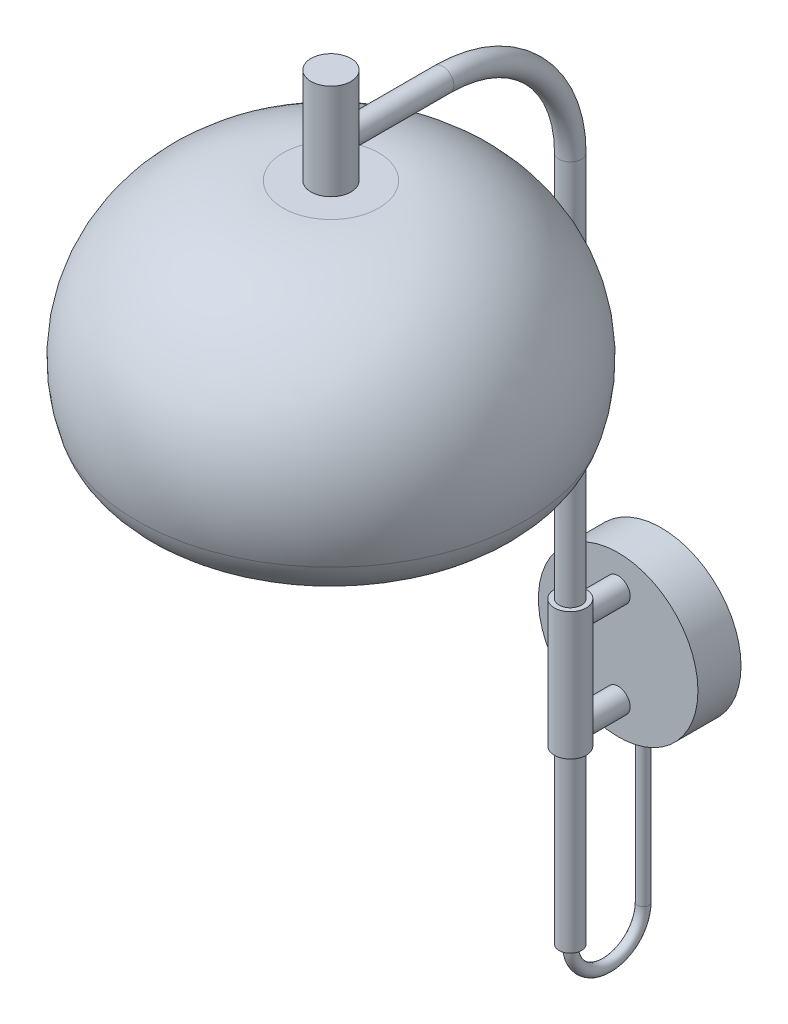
ISO-10303-21;
HEADER;
FILE_DESCRIPTION(('STEP AP214'),'2;1');
FILE_NAME('part.step','',(''),(''),'','','');
FILE_SCHEMA(('AUTOMOTIVE_DESIGN { 1 0 10303 214 1 1 1 1 }'));
ENDSEC;
DATA;
#1=APPLICATION_CONTEXT('core data for automotive mechanical design processes');
#2=APPLICATION_PROTOCOL_DEFINITION('international standard','automotive_design',2000,#1);
#3=PRODUCT_CONTEXT('',#1,'mechanical');
#4=PRODUCT('Part','Part','',(#3));
#5=PRODUCT_RELATED_PRODUCT_CATEGORY('part','',(#4));
#6=PRODUCT_DEFINITION_FORMATION('','',#4);
#7=PRODUCT_DEFINITION_CONTEXT('part definition',#1,'design');
#8=PRODUCT_DEFINITION('design','',#6,#7);
#9=PRODUCT_DEFINITION_SHAPE('','',#8);
#10=(LENGTH_UNIT() NAMED_UNIT(*) SI_UNIT(.MILLI.,.METRE.));
#11=(NAMED_UNIT(*) PLANE_ANGLE_UNIT() SI_UNIT($,.RADIAN.));
#12=(NAMED_UNIT(*) SI_UNIT($,.STERADIAN.) SOLID_ANGLE_UNIT());
#13=UNCERTAINTY_MEASURE_WITH_UNIT(LENGTH_MEASURE(1.E-05),#10,'distance_accuracy_value','');
#14=(GEOMETRIC_REPRESENTATION_CONTEXT(3) GLOBAL_UNCERTAINTY_ASSIGNED_CONTEXT((#13)) GLOBAL_UNIT_ASSIGNED_CONTEXT((#10,
#11,#12)) REPRESENTATION_CONTEXT('',''));
#15=CARTESIAN_POINT('',(0.,0.,0.));
#16=DIRECTION('',(0.,0.,1.));
#17=DIRECTION('',(1.,0.,0.));
#18=AXIS2_PLACEMENT_3D('',#15,#16,#17);
#19=CARTESIAN_POINT('',(-138.745759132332,297.714093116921,866.006204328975));
#20=DIRECTION('',(0.,0.,-1.));
#21=DIRECTION('',(-1.,0.,0.));
#22=AXIS2_PLACEMENT_3D('',#19,#20,#21);
#23=CIRCLE('',#22,40.);
#24=TRIMMED_CURVE('',#23,(PARAMETER_VALUE(-1.61579062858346)),
(PARAMETER_VALUE(1.61579062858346)),.T.,.PARAMETER.);
#25=CARTESIAN_POINT('',(-136.946594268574,297.714093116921,866.006204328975));
#26=DIRECTION('',(0.,1.,0.));
#27=AXIS1_PLACEMENT('',#25,#26);
#28=SURFACE_OF_REVOLUTION('',#24,#27);
#29=CARTESIAN_POINT('',(-136.946594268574,335.679699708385,866.006204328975));
#30=DIRECTION('',(0.,1.,0.));
#31=DIRECTION('',(-1.,0.,0.));
#32=AXIS2_PLACEMENT_3D('',#29,#30,#31);
#33=CIRCLE('',#32,14.3933189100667);
#34=CARTESIAN_POINT('',(-151.339913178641,335.679699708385,866.006204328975));
#35=VERTEX_POINT('',#34);
#36=EDGE_CURVE('P0_E10',#35,#35,#33,.T.);
#37=ORIENTED_EDGE('',*,*,#36,.F.);
#38=EDGE_LOOP('',(#37));
#39=FACE_BOUND('',#38,.T.);
#40=CARTESIAN_POINT('',(-136.946594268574,257.754576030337,866.006204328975));
#41=VERTEX_POINT('',#40);
#42=VERTEX_LOOP('',#41);
#43=FACE_BOUND('',#42,.T.);
#44=ADVANCED_FACE('P0_F16',(#39,#43),#28,.T.);
#45=CARTESIAN_POINT('',(-122.553275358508,335.679699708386,866.006204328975));
#46=DIRECTION('',(0.,-1.,0.));
#47=DIRECTION('',(1.,0.,0.));
#48=AXIS2_PLACEMENT_3D('',#45,#46,#47);
#49=PLANE('',#48);
#50=ORIENTED_EDGE('',*,*,#36,.T.);
#51=EDGE_LOOP('',(#50));
#52=FACE_BOUND('',#51,.T.);
#53=ADVANCED_FACE('P0_F24',(#52),#49,.F.);
#54=CLOSED_SHELL('',(#44,#53));
#55=MANIFOLD_SOLID_BREP('P0_B1',#54);
#56=CARTESIAN_POINT('',(-136.946594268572,377.679699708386,866.006204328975));
#57=DIRECTION('',(0.,1.,0.));
#58=DIRECTION('',(-0.999896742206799,0.,0.0143702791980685));
#59=AXIS2_PLACEMENT_3D('',#56,#57,#58);
#60=PLANE('',#59);
#61=CARTESIAN_POINT('',(-136.946594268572,377.679699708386,866.006204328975));
#62=DIRECTION('',(0.,1.,0.));
#63=DIRECTION('',(0.0143702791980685,0.,0.999896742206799));
#64=AXIS2_PLACEMENT_3D('',#61,#62,#63);
#65=CIRCLE('',#64,12.5);
#66=CARTESIAN_POINT('',(-136.766965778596,377.679699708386,878.50491360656));
#67=VERTEX_POINT('',#66);
#68=EDGE_CURVE('P1_E40',#67,#67,#65,.T.);
#69=ORIENTED_EDGE('',*,*,#68,.F.);
#70=EDGE_LOOP('',(#69));
#71=FACE_BOUND('',#70,.T.);
#72=CARTESIAN_POINT('',(-136.946594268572,377.679699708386,866.006204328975));
#73=DIRECTION('',(0.,-1.,0.));
#74=DIRECTION('',(0.999896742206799,0.,-0.0143702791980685));
#75=AXIS2_PLACEMENT_3D('',#72,#73,#74);
#76=CIRCLE('',#75,30.);
#77=CARTESIAN_POINT('',(-106.949692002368,377.679699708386,865.575095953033));
#78=VERTEX_POINT('',#77);
#79=EDGE_CURVE('P1_E10',#78,#78,#76,.T.);
#80=ORIENTED_EDGE('',*,*,#79,.F.);
#81=EDGE_LOOP('',(#80));
#82=FACE_BOUND('',#81,.T.);
#83=ADVANCED_FACE('P1_F15',(#71,#82),#60,.T.);
#84=CARTESIAN_POINT('',(-136.946594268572,281.736809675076,866.006204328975));
#85=DIRECTION('',(0.,-1.,0.));
#86=DIRECTION('',(0.999896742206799,0.,-0.0143702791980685));
#87=AXIS2_PLACEMENT_3D('',#84,#85,#86);
#88=DEGENERATE_TOROIDAL_SURFACE('',#87,30.,95.9428900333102,.T.);
#89=ORIENTED_EDGE('',*,*,#79,.T.);
#90=EDGE_LOOP('',(#89));
#91=FACE_BOUND('',#90,.T.);
#92=CARTESIAN_POINT('',(-136.946594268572,253.870083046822,866.006204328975));
#93=DIRECTION('',(0.,-1.,0.));
#94=DIRECTION('',(0.999896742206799,0.,-0.0143702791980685));
#95=AXIS2_PLACEMENT_3D('',#92,#93,#94);
#96=CIRCLE('',#95,121.806773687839);
#97=CARTESIAN_POINT('',(-15.1523980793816,253.870083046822,864.255806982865));
#98=VERTEX_POINT('',#97);
#99=EDGE_CURVE('P1_E22',#98,#98,#96,.T.);
#100=ORIENTED_EDGE('',*,*,#99,.F.);
#101=EDGE_LOOP('',(#100));
#102=FACE_BOUND('',#101,.T.);
#103=ADVANCED_FACE('P1_F68',(#91,#102),#88,.T.);
#104=CARTESIAN_POINT('',(-136.946594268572,265.488130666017,866.006204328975));
#105=DIRECTION('',(0.,-1.,0.));
#106=DIRECTION('',(0.999896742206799,0.,-0.0143702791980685));
#107=AXIS2_PLACEMENT_3D('',#104,#105,#106);
#108=TOROIDAL_SURFACE('',#107,83.531181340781,40.0000000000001);
#109=ORIENTED_EDGE('',*,*,#99,.T.);
#110=EDGE_LOOP('',(#109));
#111=FACE_BOUND('',#110,.T.);
#112=CARTESIAN_POINT('',(-136.946594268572,225.488130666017,866.006204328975));
#113=DIRECTION('',(0.,-1.,0.));
#114=DIRECTION('',(0.999896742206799,0.,-0.0143702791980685));
#115=AXIS2_PLACEMENT_3D('',#112,#113,#114);
#116=CIRCLE('',#115,83.531181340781);
#117=CARTESIAN_POINT('',(-53.4240381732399,225.488130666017,864.805837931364));
#118=VERTEX_POINT('',#117);
#119=EDGE_CURVE('P1_E26',#118,#118,#116,.T.);
#120=ORIENTED_EDGE('',*,*,#119,.F.);
#121=EDGE_LOOP('',(#120));
#122=FACE_BOUND('',#121,.T.);
#123=ADVANCED_FACE('P1_F73',(#111,#122),#108,.T.);
#124=CARTESIAN_POINT('',(-136.946594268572,226.488130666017,866.006204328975));
#125=DIRECTION('',(0.,-1.,0.));
#126=DIRECTION('',(0.999896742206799,0.,-0.0143702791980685));
#127=AXIS2_PLACEMENT_3D('',#124,#125,#126);
#128=TOROIDAL_SURFACE('',#127,83.531181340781,1.00000000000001);
#129=ORIENTED_EDGE('',*,*,#119,.T.);
#130=EDGE_LOOP('',(#129));
#131=FACE_BOUND('',#130,.T.);
#132=CARTESIAN_POINT('',(-136.946594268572,227.488130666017,866.006204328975));
#133=DIRECTION('',(0.,-1.,0.));
#134=DIRECTION('',(0.999896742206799,0.,-0.0143702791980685));
#135=AXIS2_PLACEMENT_3D('',#132,#133,#134);
#136=CIRCLE('',#135,83.531181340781);
#137=CARTESIAN_POINT('',(-53.4240381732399,227.488130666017,864.805837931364));
#138=VERTEX_POINT('',#137);
#139=EDGE_CURVE('P1_E31',#138,#138,#136,.T.);
#140=ORIENTED_EDGE('',*,*,#139,.F.);
#141=EDGE_LOOP('',(#140));
#142=FACE_BOUND('',#141,.T.);
#143=ADVANCED_FACE('P1_F64',(#131,#142),#128,.T.);
#144=CARTESIAN_POINT('',(-136.946594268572,265.488130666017,866.006204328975));
#145=DIRECTION('',(0.,-1.,0.));
#146=DIRECTION('',(0.999896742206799,0.,-0.0143702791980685));
#147=AXIS2_PLACEMENT_3D('',#144,#145,#146);
#148=TOROIDAL_SURFACE('',#147,83.531181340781,38.0000000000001);
#149=ORIENTED_EDGE('',*,*,#139,.T.);
#150=EDGE_LOOP('',(#149));
#151=FACE_BOUND('',#150,.T.);
#152=CARTESIAN_POINT('',(-136.946594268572,254.450985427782,866.006204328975));
#153=DIRECTION('',(0.,-1.,0.));
#154=DIRECTION('',(0.999896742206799,0.,-0.0143702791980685));
#155=AXIS2_PLACEMENT_3D('',#152,#153,#154);
#156=CIRCLE('',#155,119.892994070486);
#157=CARTESIAN_POINT('',(-17.0659800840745,254.450985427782,864.28330853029));
#158=VERTEX_POINT('',#157);
#159=EDGE_CURVE('P1_E34',#158,#158,#156,.T.);
#160=ORIENTED_EDGE('',*,*,#159,.F.);
#161=EDGE_LOOP('',(#160));
#162=FACE_BOUND('',#161,.T.);
#163=ADVANCED_FACE('P1_F57',(#151,#162),#148,.F.);
#164=CARTESIAN_POINT('',(-136.946594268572,281.736809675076,866.006204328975));
#165=DIRECTION('',(0.,-1.,0.));
#166=DIRECTION('',(0.999896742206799,0.,-0.0143702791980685));
#167=AXIS2_PLACEMENT_3D('',#164,#165,#166);
#168=DEGENERATE_TOROIDAL_SURFACE('',#167,30.,93.9428900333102,.T.);
#169=ORIENTED_EDGE('',*,*,#159,.T.);
#170=EDGE_LOOP('',(#169));
#171=FACE_BOUND('',#170,.T.);
#172=CARTESIAN_POINT('',(-136.946594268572,375.679699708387,866.006204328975));
#173=DIRECTION('',(0.,-1.,0.));
#174=DIRECTION('',(0.999896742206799,0.,-0.0143702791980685));
#175=AXIS2_PLACEMENT_3D('',#172,#173,#174);
#176=CIRCLE('',#175,30.);
#177=CARTESIAN_POINT('',(-106.949692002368,375.679699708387,865.575095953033));
#178=VERTEX_POINT('',#177);
#179=EDGE_CURVE('P1_E37',#178,#178,#176,.T.);
#180=ORIENTED_EDGE('',*,*,#179,.F.);
#181=EDGE_LOOP('',(#180));
#182=FACE_BOUND('',#181,.T.);
#183=ADVANCED_FACE('P1_F52',(#171,#182),#168,.F.);
#184=CARTESIAN_POINT('',(-136.946594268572,375.679699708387,866.006204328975));
#185=DIRECTION('',(0.,-1.,0.));
#186=DIRECTION('',(0.999896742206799,0.,-0.0143702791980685));
#187=AXIS2_PLACEMENT_3D('',#184,#185,#186);
#188=PLANE('',#187);
#189=CARTESIAN_POINT('',(-136.946594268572,375.679699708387,866.006204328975));
#190=DIRECTION('',(0.,-1.,0.));
#191=DIRECTION('',(0.999896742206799,0.,-0.0143702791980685));
#192=AXIS2_PLACEMENT_3D('',#189,#190,#191);
#193=CIRCLE('',#192,12.5);
#194=CARTESIAN_POINT('',(-124.447884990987,375.679699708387,865.826575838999));
#195=VERTEX_POINT('',#194);
#196=EDGE_CURVE('P1_E18',#195,#195,#193,.T.);
#197=ORIENTED_EDGE('',*,*,#196,.F.);
#198=EDGE_LOOP('',(#197));
#199=FACE_BOUND('',#198,.T.);
#200=ORIENTED_EDGE('',*,*,#179,.T.);
#201=EDGE_LOOP('',(#200));
#202=FACE_BOUND('',#201,.T.);
#203=ADVANCED_FACE('P1_F49',(#199,#202),#188,.T.);
#204=CARTESIAN_POINT('',(-136.946594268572,345.679699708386,866.006204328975));
#205=DIRECTION('',(0.,1.,0.));
#206=DIRECTION('',(0.0143702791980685,0.,0.999896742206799));
#207=AXIS2_PLACEMENT_3D('',#204,#205,#206);
#208=CYLINDRICAL_SURFACE('',#207,12.5);
#209=ORIENTED_EDGE('',*,*,#196,.T.);
#210=EDGE_LOOP('',(#209));
#211=FACE_BOUND('',#210,.T.);
#212=ORIENTED_EDGE('',*,*,#68,.T.);
#213=EDGE_LOOP('',(#212));
#214=FACE_BOUND('',#213,.T.);
#215=ADVANCED_FACE('P1_F47',(#211,#214),#208,.F.);
#216=CLOSED_SHELL('',(#83,#103,#123,#143,#163,#183,#203,#215));
#217=MANIFOLD_SOLID_BREP('P1_B1',#216);
#218=CARTESIAN_POINT('',(-136.946594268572,335.679699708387,866.006204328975));
#219=DIRECTION('',(0.,1.,0.));
#220=DIRECTION('',(0.0143702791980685,0.,0.999896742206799));
#221=AXIS2_PLACEMENT_3D('',#218,#219,#220);
#222=CYLINDRICAL_SURFACE('',#221,12.5);
#223=CARTESIAN_POINT('',(-136.946594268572,335.679699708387,866.006204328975));
#224=DIRECTION('',(0.,-1.,0.));
#225=DIRECTION('',(-0.0143702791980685,0.,-0.999896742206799));
#226=AXIS2_PLACEMENT_3D('',#223,#224,#225);
#227=CIRCLE('',#226,12.5);
#228=CARTESIAN_POINT('',(-137.126222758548,335.679699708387,853.50749505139));
#229=VERTEX_POINT('',#228);
#230=EDGE_CURVE('P2_E10',#229,#229,#227,.T.);
#231=ORIENTED_EDGE('',*,*,#230,.F.);
#232=EDGE_LOOP('',(#231));
#233=FACE_BOUND('',#232,.T.);
#234=CARTESIAN_POINT('',(-136.946594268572,370.679699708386,866.006204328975));
#235=DIRECTION('',(0.,-1.,0.));
#236=DIRECTION('',(-0.0143702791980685,0.,-0.999896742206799));
#237=AXIS2_PLACEMENT_3D('',#234,#235,#236);
#238=CIRCLE('',#237,12.5);
#239=CARTESIAN_POINT('',(-137.126222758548,370.679699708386,853.50749505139));
#240=VERTEX_POINT('',#239);
#241=EDGE_CURVE('P2_E18',#240,#240,#238,.T.);
#242=ORIENTED_EDGE('',*,*,#241,.T.);
#243=EDGE_LOOP('',(#242));
#244=FACE_BOUND('',#243,.T.);
#245=ADVANCED_FACE('P2_F15',(#233,#244),#222,.T.);
#246=CARTESIAN_POINT('',(-136.946594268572,335.679699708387,866.006204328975));
#247=DIRECTION('',(0.,-1.,0.));
#248=DIRECTION('',(-0.0143702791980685,0.,-0.999896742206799));
#249=AXIS2_PLACEMENT_3D('',#246,#247,#248);
#250=PLANE('',#249);
#251=ORIENTED_EDGE('',*,*,#230,.T.);
#252=EDGE_LOOP('',(#251));
#253=FACE_BOUND('',#252,.T.);
#254=ADVANCED_FACE('P2_F30',(#253),#250,.T.);
#255=CARTESIAN_POINT('',(-136.946594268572,370.679699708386,866.006204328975));
#256=DIRECTION('',(0.,-1.,0.));
#257=DIRECTION('',(-0.0143702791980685,0.,-0.999896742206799));
#258=AXIS2_PLACEMENT_3D('',#255,#256,#257);
#259=PLANE('',#258);
#260=ORIENTED_EDGE('',*,*,#241,.F.);
#261=EDGE_LOOP('',(#260));
#262=FACE_BOUND('',#261,.T.);
#263=ADVANCED_FACE('P2_F28',(#262),#259,.F.);
#264=CLOSED_SHELL('',(#245,#254,#263));
#265=MANIFOLD_SOLID_BREP('P2_B1',#264);
#266=CARTESIAN_POINT('',(-136.946594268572,370.679699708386,866.006204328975));
#267=DIRECTION('',(0.,1.,0.));
#268=DIRECTION('',(0.0143702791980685,0.,0.999896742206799));
#269=AXIS2_PLACEMENT_3D('',#266,#267,#268);
#270=CYLINDRICAL_SURFACE('',#269,55.);
#271=CARTESIAN_POINT('',(-136.946594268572,370.679699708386,866.006204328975));
#272=DIRECTION('',(0.,-1.,0.));
#273=DIRECTION('',(-0.0143702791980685,0.,-0.999896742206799));
#274=AXIS2_PLACEMENT_3D('',#271,#272,#273);
#275=CIRCLE('',#274,55.);
#276=CARTESIAN_POINT('',(-137.736959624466,370.679699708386,811.011883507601));
#277=VERTEX_POINT('',#276);
#278=EDGE_CURVE('P3_E10',#277,#277,#275,.T.);
#279=ORIENTED_EDGE('',*,*,#278,.F.);
#280=EDGE_LOOP('',(#279));
#281=FACE_BOUND('',#280,.T.);
#282=CARTESIAN_POINT('',(-136.946594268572,372.679699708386,866.006204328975));
#283=DIRECTION('',(0.,-1.,0.));
#284=DIRECTION('',(-0.0143702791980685,0.,-0.999896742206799));
#285=AXIS2_PLACEMENT_3D('',#282,#283,#284);
#286=CIRCLE('',#285,55.);
#287=CARTESIAN_POINT('',(-137.736959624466,372.679699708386,811.011883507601));
#288=VERTEX_POINT('',#287);
#289=EDGE_CURVE('P3_E22',#288,#288,#286,.T.);
#290=ORIENTED_EDGE('',*,*,#289,.T.);
#291=EDGE_LOOP('',(#290));
#292=FACE_BOUND('',#291,.T.);
#293=ADVANCED_FACE('P3_F15',(#281,#292),#270,.T.);
#294=CARTESIAN_POINT('',(-136.946594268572,370.679699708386,866.006204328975));
#295=DIRECTION('',(0.,-1.,0.));
#296=DIRECTION('',(-0.0143702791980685,0.,-0.999896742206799));
#297=AXIS2_PLACEMENT_3D('',#294,#295,#296);
#298=PLANE('',#297);
#299=CARTESIAN_POINT('',(-136.946594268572,370.679699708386,866.006204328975));
#300=DIRECTION('',(0.,-1.,0.));
#301=DIRECTION('',(-0.0143702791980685,0.,-0.999896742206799));
#302=AXIS2_PLACEMENT_3D('',#299,#300,#301);
#303=CIRCLE('',#302,12.5);
#304=CARTESIAN_POINT('',(-137.126222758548,370.679699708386,853.50749505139));
#305=VERTEX_POINT('',#304);
#306=EDGE_CURVE('P3_E27',#305,#305,#303,.T.);
#307=ORIENTED_EDGE('',*,*,#306,.F.);
#308=EDGE_LOOP('',(#307));
#309=FACE_BOUND('',#308,.T.);
#310=ORIENTED_EDGE('',*,*,#278,.T.);
#311=EDGE_LOOP('',(#310));
#312=FACE_BOUND('',#311,.T.);
#313=ADVANCED_FACE('P3_F45',(#309,#312),#298,.T.);
#314=CARTESIAN_POINT('',(-136.946594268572,372.679699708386,866.006204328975));
#315=DIRECTION('',(0.,-1.,0.));
#316=DIRECTION('',(-0.0143702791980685,0.,-0.999896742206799));
#317=AXIS2_PLACEMENT_3D('',#314,#315,#316);
#318=PLANE('',#317);
#319=CARTESIAN_POINT('',(-136.946594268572,372.679699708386,866.006204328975));
#320=DIRECTION('',(0.,-1.,0.));
#321=DIRECTION('',(-0.0143702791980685,0.,-0.999896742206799));
#322=AXIS2_PLACEMENT_3D('',#319,#320,#321);
#323=CIRCLE('',#322,12.5);
#324=CARTESIAN_POINT('',(-137.126222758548,372.679699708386,853.50749505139));
#325=VERTEX_POINT('',#324);
#326=EDGE_CURVE('P3_E18',#325,#325,#323,.T.);
#327=ORIENTED_EDGE('',*,*,#326,.T.);
#328=EDGE_LOOP('',(#327));
#329=FACE_BOUND('',#328,.T.);
#330=ORIENTED_EDGE('',*,*,#289,.F.);
#331=EDGE_LOOP('',(#330));
#332=FACE_BOUND('',#331,.T.);
#333=ADVANCED_FACE('P3_F35',(#329,#332),#318,.F.);
#334=CARTESIAN_POINT('',(-136.946594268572,345.679699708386,866.006204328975));
#335=DIRECTION('',(0.,1.,0.));
#336=DIRECTION('',(0.0143702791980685,0.,0.999896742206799));
#337=AXIS2_PLACEMENT_3D('',#334,#335,#336);
#338=CYLINDRICAL_SURFACE('',#337,12.5);
#339=ORIENTED_EDGE('',*,*,#306,.T.);
#340=EDGE_LOOP('',(#339));
#341=FACE_BOUND('',#340,.T.);
#342=ORIENTED_EDGE('',*,*,#326,.F.);
#343=EDGE_LOOP('',(#342));
#344=FACE_BOUND('',#343,.T.);
#345=ADVANCED_FACE('P3_F38',(#341,#344),#338,.F.);
#346=CLOSED_SHELL('',(#293,#313,#333,#345));
#347=MANIFOLD_SOLID_BREP('P3_B1',#346);
#348=CARTESIAN_POINT('',(-136.946594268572,-111.820300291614,693.178258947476));
#349=DIRECTION('',(-1.,0.,0.));
#350=DIRECTION('',(0.,0.,1.));
#351=AXIS2_PLACEMENT_3D('',#348,#349,#350);
#352=TOROIDAL_SURFACE('',#351,22.8279453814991,3.5);
#353=CARTESIAN_POINT('',(-136.946594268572,-111.820300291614,670.350313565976));
#354=DIRECTION('',(0.,-1.,0.));
#355=DIRECTION('',(1.,0.,0.));
#356=AXIS2_PLACEMENT_3D('',#353,#354,#355);
#357=CIRCLE('',#356,3.5);
#358=CARTESIAN_POINT('',(-133.446594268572,-111.820300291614,670.350313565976));
#359=VERTEX_POINT('',#358);
#360=EDGE_CURVE('P4_E30',#359,#359,#357,.T.);
#361=ORIENTED_EDGE('',*,*,#360,.T.);
#362=CARTESIAN_POINT('',(-133.446594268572,-111.820300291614,693.178258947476));
#363=DIRECTION('',(-1.,0.,0.));
#364=DIRECTION('',(0.,0.,-1.));
#365=AXIS2_PLACEMENT_3D('',#362,#363,#364);
#366=CIRCLE('',#365,22.8279453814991);
#367=CARTESIAN_POINT('',(-133.446594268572,-111.820300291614,716.006204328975));
#368=VERTEX_POINT('',#367);
#369=EDGE_CURVE('P4_E18',#359,#368,#366,.T.);
#370=ORIENTED_EDGE('',*,*,#369,.T.);
#371=CARTESIAN_POINT('',(-136.946594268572,-111.820300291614,716.006204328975));
#372=DIRECTION('',(0.,1.,0.));
#373=DIRECTION('',(1.,0.,0.));
#374=AXIS2_PLACEMENT_3D('',#371,#372,#373);
#375=CIRCLE('',#374,3.5);
#376=EDGE_CURVE('P4_E11',#368,#368,#375,.T.);
#377=ORIENTED_EDGE('',*,*,#376,.F.);
#378=ORIENTED_EDGE('',*,*,#369,.F.);
#379=EDGE_LOOP('',(#361,#370,#377,#378));
#380=FACE_BOUND('',#379,.T.);
#381=ADVANCED_FACE('P4_F17',(#380),#352,.T.);
#382=OPEN_SHELL('',(#381));
#383=SHELL_BASED_SURFACE_MODEL('P4_B1',(#382));
#384=CARTESIAN_POINT('',(-136.946594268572,75.6796997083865,716.006204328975));
#385=DIRECTION('',(0.,-1.,0.));
#386=DIRECTION('',(0.,0.,-1.));
#387=AXIS2_PLACEMENT_3D('',#384,#385,#386);
#388=CYLINDRICAL_SURFACE('',#387,10.);
#389=CARTESIAN_POINT('',(-136.946594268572,-4.32030029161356,716.006204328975));
#390=DIRECTION('',(0.,1.,0.));
#391=DIRECTION('',(0.,0.,1.));
#392=AXIS2_PLACEMENT_3D('',#389,#390,#391);
#393=CIRCLE('',#392,10.);
#394=CARTESIAN_POINT('',(-136.946594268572,-4.32030029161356,726.006204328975));
#395=VERTEX_POINT('',#394);
#396=EDGE_CURVE('P5_E50',#395,#395,#393,.T.);
#397=ORIENTED_EDGE('',*,*,#396,.T.);
#398=EDGE_LOOP('',(#397));
#399=FACE_BOUND('',#398,.T.);
#400=CARTESIAN_POINT('',(-136.946594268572,75.6796997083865,716.006204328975));
#401=DIRECTION('',(0.,1.,0.));
#402=DIRECTION('',(0.,0.,1.));
#403=AXIS2_PLACEMENT_3D('',#400,#401,#402);
#404=CIRCLE('',#403,10.);
#405=CARTESIAN_POINT('',(-136.946594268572,75.6796997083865,726.006204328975));
#406=VERTEX_POINT('',#405);
#407=EDGE_CURVE('P5_E51',#406,#406,#404,.T.);
#408=ORIENTED_EDGE('',*,*,#407,.F.);
#409=EDGE_LOOP('',(#408));
#410=FACE_BOUND('',#409,.T.);
#411=CARTESIAN_POINT('',(-144.446594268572,65.6796997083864,709.391826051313));
#412=CARTESIAN_POINT('',(-144.446592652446,65.5046569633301,709.391822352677));
#413=CARTESIAN_POINT('',(-144.440448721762,65.3295805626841,709.384837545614));
#414=CARTESIAN_POINT('',(-144.416050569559,64.9813288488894,709.357328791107));
#415=CARTESIAN_POINT('',(-144.397792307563,64.808154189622,709.336800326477));
#416=CARTESIAN_POINT('',(-144.349608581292,64.4650104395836,709.283357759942));
#417=CARTESIAN_POINT('',(-144.319657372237,64.295049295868,709.250416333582));
#418=CARTESIAN_POINT('',(-144.248748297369,63.9598369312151,709.173835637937));
#419=CARTESIAN_POINT('',(-144.207783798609,63.7945886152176,709.130189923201));
#420=CARTESIAN_POINT('',(-144.116231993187,63.4719840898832,709.034792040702));
#421=CARTESIAN_POINT('',(-144.0657915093,63.3145485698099,708.983165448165));
#422=CARTESIAN_POINT('',(-143.955560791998,63.0055067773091,708.873149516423));
#423=CARTESIAN_POINT('',(-143.895771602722,62.85389985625,708.814760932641));
#424=CARTESIAN_POINT('',(-143.703174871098,62.4080909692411,708.631939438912));
#425=CARTESIAN_POINT('',(-143.557067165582,62.1226558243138,708.499773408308));
#426=CARTESIAN_POINT('',(-143.296683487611,61.6842888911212,708.280081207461));
#427=CARTESIAN_POINT('',(-143.19262436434,61.5235465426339,708.195539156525));
#428=CARTESIAN_POINT('',(-142.972955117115,61.2109806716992,708.024832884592));
#429=CARTESIAN_POINT('',(-142.857344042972,61.0591578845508,707.938668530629));
#430=CARTESIAN_POINT('',(-142.614687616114,60.7644986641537,707.766367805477));
#431=CARTESIAN_POINT('',(-142.487625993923,60.6216755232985,707.680231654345));
#432=CARTESIAN_POINT('',(-142.22240487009,60.3456152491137,707.509694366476));
#433=CARTESIAN_POINT('',(-142.08424532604,60.2123781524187,707.425293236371));
#434=CARTESIAN_POINT('',(-141.767604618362,59.9297750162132,707.242773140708));
#435=CARTESIAN_POINT('',(-141.586656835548,59.7826856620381,707.145380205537));
#436=CARTESIAN_POINT('',(-141.209321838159,59.5044178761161,706.957803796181));
#437=CARTESIAN_POINT('',(-141.01293116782,59.3732430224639,706.86762194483));
#438=CARTESIAN_POINT('',(-140.605864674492,59.1286686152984,706.697158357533));
#439=CARTESIAN_POINT('',(-140.395216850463,59.015235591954,706.616858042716));
#440=CARTESIAN_POINT('',(-139.960552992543,58.8077299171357,706.468452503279));
#441=CARTESIAN_POINT('',(-139.73654411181,58.7136470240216,706.400340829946));
#442=CARTESIAN_POINT('',(-139.346365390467,58.5719393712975,706.296998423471));
#443=CARTESIAN_POINT('',(-139.183136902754,58.5188620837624,706.258047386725));
#444=CARTESIAN_POINT('',(-138.851887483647,58.4237000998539,706.187930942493));
#445=CARTESIAN_POINT('',(-138.683867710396,58.3816127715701,706.156763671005));
#446=CARTESIAN_POINT('',(-138.344131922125,58.3090116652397,706.102848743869));
#447=CARTESIAN_POINT('',(-138.172418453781,58.2784901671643,706.080095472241));
#448=CARTESIAN_POINT('',(-137.826338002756,58.2294250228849,706.043457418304));
#449=CARTESIAN_POINT('',(-137.651970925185,58.2108818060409,706.029572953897));
#450=CARTESIAN_POINT('',(-137.301415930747,58.1860318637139,706.010955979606));
#451=CARTESIAN_POINT('',(-137.125224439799,58.1797573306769,706.006247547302));
#452=CARTESIAN_POINT('',(-136.772835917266,58.1796428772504,706.006161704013));
#453=CARTESIAN_POINT('',(-136.596638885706,58.1858029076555,706.010784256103));
#454=CARTESIAN_POINT('',(-136.245566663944,58.2104606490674,706.029257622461));
#455=CARTESIAN_POINT('',(-136.070691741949,58.2289607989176,706.043110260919));
#456=CARTESIAN_POINT('',(-135.72359713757,58.2780105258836,706.079737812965));
#457=CARTESIAN_POINT('',(-135.551377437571,58.3085600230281,706.102512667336));
#458=CARTESIAN_POINT('',(-135.216649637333,58.3800042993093,706.15556983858));
#459=CARTESIAN_POINT('',(-135.054011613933,58.4205049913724,706.185565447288));
#460=CARTESIAN_POINT('',(-134.733178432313,58.5118096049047,706.252861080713));
#461=CARTESIAN_POINT('',(-134.574984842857,58.5626171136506,706.290163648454));
#462=CARTESIAN_POINT('',(-134.108356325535,58.7296369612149,706.412064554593));
#463=CARTESIAN_POINT('',(-133.807631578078,58.8604993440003,706.506695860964));
#464=CARTESIAN_POINT('',(-133.20046440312,59.1723558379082,706.72815568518));
#465=CARTESIAN_POINT('',(-132.896928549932,59.3572438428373,706.857360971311));
#466=CARTESIAN_POINT('',(-132.323746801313,59.7633845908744,707.133185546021));
#467=CARTESIAN_POINT('',(-132.054130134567,59.984668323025,707.279819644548));
#468=CARTESIAN_POINT('',(-131.651785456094,60.3638855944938,707.521161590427));
#469=CARTESIAN_POINT('',(-131.507541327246,60.5116088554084,707.613095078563));
#470=CARTESIAN_POINT('',(-131.23198999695,60.8180382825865,707.798231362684));
#471=CARTESIAN_POINT('',(-131.100685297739,60.9767465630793,707.891434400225));
#472=CARTESIAN_POINT('',(-130.851287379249,61.3048026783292,708.077054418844));
#473=CARTESIAN_POINT('',(-130.733201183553,61.4741560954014,708.169470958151));
#474=CARTESIAN_POINT('',(-130.510723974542,61.8232252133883,708.351129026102));
#475=CARTESIAN_POINT('',(-130.40632990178,62.0029385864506,708.440371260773));
#476=CARTESIAN_POINT('',(-130.231022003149,62.3361691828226,708.59594155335));
#477=CARTESIAN_POINT('',(-130.157565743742,62.4878623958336,708.663317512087));
#478=CARTESIAN_POINT('',(-130.020281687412,62.7978710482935,708.79266925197));
#479=CARTESIAN_POINT('',(-129.956456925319,62.956188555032,708.854643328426));
#480=CARTESIAN_POINT('',(-129.839156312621,63.2789186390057,708.971209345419));
#481=CARTESIAN_POINT('',(-129.785662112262,63.4433197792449,709.025814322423));
#482=CARTESIAN_POINT('',(-129.689620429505,63.7779657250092,709.125714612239));
#483=CARTESIAN_POINT('',(-129.647065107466,63.9482062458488,709.171016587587));
#484=CARTESIAN_POINT('',(-129.580904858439,64.2595931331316,709.242440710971));
#485=CARTESIAN_POINT('',(-129.555216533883,64.3998340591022,709.270584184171));
#486=CARTESIAN_POINT('',(-129.511754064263,64.6828875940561,709.318588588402));
#487=CARTESIAN_POINT('',(-129.493975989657,64.8256988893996,709.338453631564));
#488=CARTESIAN_POINT('',(-129.466648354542,65.1129519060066,709.36912407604));
#489=CARTESIAN_POINT('',(-129.457091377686,65.2573920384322,709.379937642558));
#490=CARTESIAN_POINT('',(-129.446368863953,65.546988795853,709.392076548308));
#491=CARTESIAN_POINT('',(-129.445203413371,65.6921454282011,709.393401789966));
#492=CARTESIAN_POINT('',(-129.451289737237,65.9820991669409,709.386504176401));
#493=CARTESIAN_POINT('',(-129.458544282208,66.1268961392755,709.378278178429));
#494=CARTESIAN_POINT('',(-129.481327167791,66.4150040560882,709.35262800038));
#495=CARTESIAN_POINT('',(-129.496855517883,66.5583149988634,709.335203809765));
#496=CARTESIAN_POINT('',(-129.535922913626,66.8427042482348,709.291831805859));
#497=CARTESIAN_POINT('',(-129.55947188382,66.983779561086,709.265873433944));
#498=CARTESIAN_POINT('',(-129.614213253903,67.2628710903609,709.206364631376));
#499=CARTESIAN_POINT('',(-129.645410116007,67.4008854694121,709.172809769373));
#500=CARTESIAN_POINT('',(-129.72806356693,67.7242329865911,709.085390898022));
#501=CARTESIAN_POINT('',(-129.782733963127,67.9079650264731,709.028624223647));
#502=CARTESIAN_POINT('',(-129.904752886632,68.2678687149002,708.905501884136));
#503=CARTESIAN_POINT('',(-129.97210754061,68.4440366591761,708.839141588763));
#504=CARTESIAN_POINT('',(-130.118755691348,68.7886766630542,708.699296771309));
#505=CARTESIAN_POINT('',(-130.198065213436,68.9571379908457,708.625802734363));
#506=CARTESIAN_POINT('',(-130.367918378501,69.285981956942,708.474006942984));
#507=CARTESIAN_POINT('',(-130.45846100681,69.4463653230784,708.395705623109));
#508=CARTESIAN_POINT('',(-130.653730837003,69.7645413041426,708.233395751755));
#509=CARTESIAN_POINT('',(-130.758846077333,69.922042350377,708.149283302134));
#510=CARTESIAN_POINT('',(-130.980343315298,70.2282787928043,707.979791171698));
#511=CARTESIAN_POINT('',(-131.096729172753,70.3770111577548,707.894411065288));
#512=CARTESIAN_POINT('',(-131.340546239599,70.6654690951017,707.72403362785));
#513=CARTESIAN_POINT('',(-131.467980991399,70.805191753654,707.639036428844));
#514=CARTESIAN_POINT('',(-131.733672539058,71.0751904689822,707.470973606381));
#515=CARTESIAN_POINT('',(-131.871929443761,71.2054664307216,707.387908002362));
#516=CARTESIAN_POINT('',(-132.190497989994,71.4834462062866,707.207341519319));
#517=CARTESIAN_POINT('',(-132.373396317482,71.6287349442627,707.110654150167));
#518=CARTESIAN_POINT('',(-132.754573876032,71.9032133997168,706.924798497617));
#519=CARTESIAN_POINT('',(-132.952856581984,72.0323994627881,706.835631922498));
#520=CARTESIAN_POINT('',(-133.363639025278,72.272799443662,706.667489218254));
#521=CARTESIAN_POINT('',(-133.576113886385,72.3840436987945,706.588495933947));
#522=CARTESIAN_POINT('',(-134.014259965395,72.5869143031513,706.44301371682));
#523=CARTESIAN_POINT('',(-134.239923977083,72.6785512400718,706.376518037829));
#524=CARTESIAN_POINT('',(-134.632007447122,72.8156465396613,706.276339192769));
#525=CARTESIAN_POINT('',(-134.795529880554,72.8666680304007,706.23883142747));
#526=CARTESIAN_POINT('',(-135.127172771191,72.9576974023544,706.171657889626));
#527=CARTESIAN_POINT('',(-135.295292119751,72.997707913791,706.141990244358));
#528=CARTESIAN_POINT('',(-135.635009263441,73.0661568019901,706.091103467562));
#529=CARTESIAN_POINT('',(-135.80660454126,73.0946032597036,706.069878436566));
#530=CARTESIAN_POINT('',(-136.152226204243,73.1395485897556,706.036293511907));
#531=CARTESIAN_POINT('',(-136.326252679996,73.1560470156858,706.023933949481));
#532=CARTESIAN_POINT('',(-136.675857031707,73.1768616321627,706.008335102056));
#533=CARTESIAN_POINT('',(-136.851437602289,73.181148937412,706.005117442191));
#534=CARTESIAN_POINT('',(-137.202390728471,73.1773902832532,706.007936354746));
#535=CARTESIAN_POINT('',(-137.377763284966,73.1693443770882,706.013972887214));
#536=CARTESIAN_POINT('',(-137.72700012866,73.1410445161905,706.035167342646));
#537=CARTESIAN_POINT('',(-137.900864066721,73.1207878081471,706.050327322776));
#538=CARTESIAN_POINT('',(-138.245776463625,73.068377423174,706.089437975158));
#539=CARTESIAN_POINT('',(-138.416824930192,73.0362237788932,706.113388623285));
#540=CARTESIAN_POINT('',(-138.750011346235,72.9615927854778,706.168757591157));
#541=CARTESIAN_POINT('',(-138.912263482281,72.9194460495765,706.199936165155));
#542=CARTESIAN_POINT('',(-139.232187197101,72.8249028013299,706.269525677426));
#543=CARTESIAN_POINT('',(-139.389857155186,72.772502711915,706.307939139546));
#544=CARTESIAN_POINT('',(-139.854737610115,72.6008019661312,706.43304133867));
#545=CARTESIAN_POINT('',(-140.154059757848,72.4669457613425,706.529633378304));
#546=CARTESIAN_POINT('',(-140.759377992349,72.1483013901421,706.755326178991));
#547=CARTESIAN_POINT('',(-141.062289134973,71.9594613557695,706.886870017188));
#548=CARTESIAN_POINT('',(-141.633679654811,71.5453511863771,707.166945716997));
#549=CARTESIAN_POINT('',(-141.902126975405,71.3200475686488,707.315493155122));
#550=CARTESIAN_POINT('',(-142.302327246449,70.9341762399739,707.559486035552));
#551=CARTESIAN_POINT('',(-142.445750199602,70.7838457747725,707.652357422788));
#552=CARTESIAN_POINT('',(-142.719443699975,70.4721134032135,707.83909802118));
#553=CARTESIAN_POINT('',(-142.849711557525,70.3107092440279,707.932967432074));
#554=CARTESIAN_POINT('',(-143.09678896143,69.9771654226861,708.119564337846));
#555=CARTESIAN_POINT('',(-143.213592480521,69.8050210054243,708.212291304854));
#556=CARTESIAN_POINT('',(-143.433231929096,69.4502489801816,708.394119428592));
#557=CARTESIAN_POINT('',(-143.536071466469,69.2676240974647,708.483221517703));
#558=CARTESIAN_POINT('',(-143.706487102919,68.9325644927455,708.636400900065));
#559=CARTESIAN_POINT('',(-143.776881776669,68.7821305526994,708.701726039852));
#560=CARTESIAN_POINT('',(-143.908260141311,68.4748973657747,708.826828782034));
#561=CARTESIAN_POINT('',(-143.969241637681,68.3180966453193,708.886605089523));
#562=CARTESIAN_POINT('',(-144.081064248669,67.9987243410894,708.998665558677));
#563=CARTESIAN_POINT('',(-144.131928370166,67.836166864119,709.050966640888));
#564=CARTESIAN_POINT('',(-144.222980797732,67.5055228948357,709.14628235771));
#565=CARTESIAN_POINT('',(-144.263173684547,67.3374388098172,709.189300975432));
#566=CARTESIAN_POINT('',(-144.346422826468,66.9258173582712,709.279553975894));
#567=CARTESIAN_POINT('',(-144.383806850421,66.6797859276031,709.321192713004));
#568=CARTESIAN_POINT('',(-144.421380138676,66.306808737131,709.363322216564));
#569=CARTESIAN_POINT('',(-144.430820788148,66.1818203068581,709.373977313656));
#570=CARTESIAN_POINT('',(-144.443427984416,65.9311268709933,709.388230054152));
#571=CARTESIAN_POINT('',(-144.446595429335,65.8054219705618,709.391828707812));
#572=CARTESIAN_POINT('',(-144.446594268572,65.6796997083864,709.391826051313));
#573=B_SPLINE_CURVE_WITH_KNOTS('',3,(#411,#412,#413,#414,#415,#416,#417,#418,#419,#420,#421,
#422,#423,#424,#425,#426,#427,#428,#429,#430,#431,#432,#433,#434,#435,#436,#437,#438,#439,#440,
#441,#442,#443,#444,#445,#446,#447,#448,#449,#450,#451,#452,#453,#454,#455,#456,#457,#458,#459,
#460,#461,#462,#463,#464,#465,#466,#467,#468,#469,#470,#471,#472,#473,#474,#475,#476,#477,#478,
#479,#480,#481,#482,#483,#484,#485,#486,#487,#488,#489,#490,#491,#492,#493,#494,#495,#496,#497,
#498,#499,#500,#501,#502,#503,#504,#505,#506,#507,#508,#509,#510,#511,#512,#513,#514,#515,#516,
#517,#518,#519,#520,#521,#522,#523,#524,#525,#526,#527,#528,#529,#530,#531,#532,#533,#534,#535,
#536,#537,#538,#539,#540,#541,#542,#543,#544,#545,#546,#547,#548,#549,#550,#551,#552,#553,#554,
#555,#556,#557,#558,#559,#560,#561,#562,#563,#564,#565,#566,#567,#568,#569,#570,#571,#572),
.UNSPECIFIED.,.T.,.F.,(4,2,2,2,2,2,2,2,2,2,2,2,2,2,2,2,2,2,2,2,2,2,2,2,2,2,2,2,2,2,2,2,2,2,2,2,
2,2,2,2,2,2,2,2,2,2,2,2,2,2,2,2,2,2,2,2,2,2,2,2,2,2,2,2,2,2,2,2,2,2,2,2,2,2,2,2,2,2,2,2,4),(0.,
0.524946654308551,1.05006848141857,1.57635306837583,2.1029553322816,2.62198622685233,
3.14095919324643,4.17811218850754,4.80566508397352,5.43326964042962,6.06178042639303,
6.69029361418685,7.44738762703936,8.20465154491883,8.96046919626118,9.71588577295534,
10.2433789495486,10.7707456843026,11.297759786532,11.8247927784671,12.3532068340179,
12.8816187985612,13.4101352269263,13.9386481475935,14.4488928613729,14.9593154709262,
15.9794159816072,17.1099698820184,18.2414914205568,18.9189650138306,19.5965693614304,
20.2745320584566,20.952343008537,21.4964710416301,22.0407701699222,22.5840934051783,
23.1270261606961,23.5625720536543,23.9979013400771,24.4328374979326,24.8677781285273,
25.3028619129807,25.7379461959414,26.1735708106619,26.609450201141,27.2082971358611,
27.8074340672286,28.4073813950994,29.0072745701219,29.6283553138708,30.2496495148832,
30.8711436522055,31.4926440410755,32.2499956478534,33.0075188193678,33.7637473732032,
34.5195665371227,35.0451096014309,35.57052701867,36.0955766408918,36.6206458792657,
37.1469561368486,37.6732641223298,38.1996908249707,38.7261160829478,39.2370944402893,
39.7482513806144,40.7698210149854,41.9071133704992,43.045456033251,43.7276445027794,
44.4099721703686,45.0926041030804,45.7750593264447,46.310085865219,46.8452369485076,
47.3791568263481,47.9128471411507,48.6669364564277,49.0440268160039,49.4210631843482),.UNSPECIFIED.);
#574=CARTESIAN_POINT('',(-144.446594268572,65.6796997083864,709.391826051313));
#575=VERTEX_POINT('',#574);
#576=EDGE_CURVE('P5_E59',#575,#575,#573,.T.);
#577=ORIENTED_EDGE('',*,*,#576,.T.);
#578=EDGE_LOOP('',(#577));
#579=FACE_BOUND('',#578,.T.);
#580=CARTESIAN_POINT('',(-136.946594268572,13.1796997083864,706.006204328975));
#581=CARTESIAN_POINT('',(-136.763445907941,13.1796978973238,706.006206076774));
#582=CARTESIAN_POINT('',(-136.580251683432,13.1729787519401,706.01124811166));
#583=CARTESIAN_POINT('',(-136.215309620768,13.1462072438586,706.031302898));
#584=CARTESIAN_POINT('',(-136.033562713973,13.1261469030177,706.046321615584));
#585=CARTESIAN_POINT('',(-135.672701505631,13.0729749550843,706.08601254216));
#586=CARTESIAN_POINT('',(-135.493592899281,13.0398384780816,706.110703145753));
#587=CARTESIAN_POINT('',(-135.13960489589,12.9610246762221,706.169182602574));
#588=CARTESIAN_POINT('',(-134.964727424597,12.9153417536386,706.202975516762));
#589=CARTESIAN_POINT('',(-134.621524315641,12.8124360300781,706.278680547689));
#590=CARTESIAN_POINT('',(-134.453163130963,12.7552911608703,706.320537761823));
#591=CARTESIAN_POINT('',(-134.122638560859,12.6299913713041,706.411689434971));
#592=CARTESIAN_POINT('',(-133.960477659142,12.5618320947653,706.460986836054));
#593=CARTESIAN_POINT('',(-133.484670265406,12.3420518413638,706.618635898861));
#594=CARTESIAN_POINT('',(-133.181252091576,12.17499186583,706.73684659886));
#595=CARTESIAN_POINT('',(-132.579213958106,11.7883704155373,707.003733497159));
#596=CARTESIAN_POINT('',(-132.283640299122,11.5653797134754,707.154217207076));
#597=CARTESIAN_POINT('',(-131.731446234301,11.0822038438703,707.467875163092));
#598=CARTESIAN_POINT('',(-131.474887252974,10.8219612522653,707.631068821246));
#599=CARTESIAN_POINT('',(-131.096761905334,10.3783604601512,707.893898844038));
#600=CARTESIAN_POINT('',(-130.962107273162,10.205623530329,707.992981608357));
#601=CARTESIAN_POINT('',(-130.707885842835,9.8482277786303,708.189281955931));
#602=CARTESIAN_POINT('',(-130.588323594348,9.66356538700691,708.286498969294));
#603=CARTESIAN_POINT('',(-130.365041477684,9.28272857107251,708.475959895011));
#604=CARTESIAN_POINT('',(-130.261305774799,9.0865659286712,708.568208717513));
#605=CARTESIAN_POINT('',(-130.070481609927,8.68285679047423,708.74425440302));
#606=CARTESIAN_POINT('',(-129.983383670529,8.47531686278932,708.828056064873));
#607=CARTESIAN_POINT('',(-129.802585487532,7.9822461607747,709.007344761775));
#608=CARTESIAN_POINT('',(-129.715290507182,7.69257069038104,709.098331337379));
#609=CARTESIAN_POINT('',(-129.610426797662,7.2462299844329,709.21037727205));
#610=CARTESIAN_POINT('',(-129.579828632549,7.09556702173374,709.243641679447));
#611=CARTESIAN_POINT('',(-129.527769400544,6.79094803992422,709.300793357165));
#612=CARTESIAN_POINT('',(-129.50630362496,6.63699376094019,709.324685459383));
#613=CARTESIAN_POINT('',(-129.472774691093,6.32531503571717,709.362209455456));
#614=CARTESIAN_POINT('',(-129.460802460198,6.16756869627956,709.375742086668));
#615=CARTESIAN_POINT('',(-129.446879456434,5.85106613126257,709.391494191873));
#616=CARTESIAN_POINT('',(-129.444928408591,5.6923099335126,709.393713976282));
#617=CARTESIAN_POINT('',(-129.451100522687,5.3751926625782,709.386718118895));
#618=CARTESIAN_POINT('',(-129.459226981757,5.21683173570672,709.37749873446));
#619=CARTESIAN_POINT('',(-129.485350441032,4.90199291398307,709.348110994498));
#620=CARTESIAN_POINT('',(-129.503347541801,4.74551503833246,709.327942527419));
#621=CARTESIAN_POINT('',(-129.566707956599,4.31395002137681,709.257794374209));
#622=CARTESIAN_POINT('',(-129.622464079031,4.04209414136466,709.196839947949));
#623=CARTESIAN_POINT('',(-129.76131658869,3.51242895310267,709.050501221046));
#624=CARTESIAN_POINT('',(-129.844439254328,3.25463342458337,708.965093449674));
#625=CARTESIAN_POINT('',(-130.017420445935,2.80153022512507,708.795212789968));
#626=CARTESIAN_POINT('',(-130.103125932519,2.60354028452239,708.713540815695));
#627=CARTESIAN_POINT('',(-130.289768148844,2.2181187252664,708.542782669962));
#628=CARTESIAN_POINT('',(-130.390712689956,2.03069258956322,708.453692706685));
#629=CARTESIAN_POINT('',(-130.607262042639,1.66623587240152,708.271026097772));
#630=CARTESIAN_POINT('',(-130.722896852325,1.48922767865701,708.17744052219));
#631=CARTESIAN_POINT('',(-130.968149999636,1.14619682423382,707.988588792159));
#632=CARTESIAN_POINT('',(-131.097766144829,0.980172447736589,707.893322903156));
#633=CARTESIAN_POINT('',(-131.374120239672,0.655344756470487,707.700989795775));
#634=CARTESIAN_POINT('',(-131.521207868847,0.49682961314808,707.603937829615));
#635=CARTESIAN_POINT('',(-131.829503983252,0.192228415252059,707.412701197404));
#636=CARTESIAN_POINT('',(-131.990713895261,0.0461436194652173,707.318516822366));
#637=CARTESIAN_POINT('',(-132.326659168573,-0.232468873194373,707.13531108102));
#638=CARTESIAN_POINT('',(-132.501371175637,-0.365019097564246,707.046281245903));
#639=CARTESIAN_POINT('',(-132.864100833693,-0.615680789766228,706.875299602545));
#640=CARTESIAN_POINT('',(-133.052115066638,-0.733795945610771,706.793345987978));
#641=CARTESIAN_POINT('',(-133.401758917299,-0.932110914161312,706.654086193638));
#642=CARTESIAN_POINT('',(-133.561119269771,-1.01516427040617,706.595132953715));
#643=CARTESIAN_POINT('',(-133.887345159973,-1.17038117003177,706.484089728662));
#644=CARTESIAN_POINT('',(-134.0542091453,-1.24254695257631,706.431998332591));
#645=CARTESIAN_POINT('',(-134.394669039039,-1.37515936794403,706.335684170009));
#646=CARTESIAN_POINT('',(-134.568262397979,-1.43561038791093,706.291458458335));
#647=CARTESIAN_POINT('',(-134.921286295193,-1.54402628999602,706.21177399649));
#648=CARTESIAN_POINT('',(-135.100716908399,-1.59199101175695,706.176315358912));
#649=CARTESIAN_POINT('',(-135.465354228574,-1.674965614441,706.114777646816));
#650=CARTESIAN_POINT('',(-135.650590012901,-1.70989270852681,706.088758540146));
#651=CARTESIAN_POINT('',(-136.024317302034,-1.76577539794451,706.047050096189));
#652=CARTESIAN_POINT('',(-136.212808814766,-1.7867309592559,706.031360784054));
#653=CARTESIAN_POINT('',(-136.591363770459,-1.81428553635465,706.01071877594));
#654=CARTESIAN_POINT('',(-136.78142666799,-1.82088933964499,706.005762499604));
#655=CARTESIAN_POINT('',(-137.161468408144,-1.81962888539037,706.006707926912));
#656=CARTESIAN_POINT('',(-137.351447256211,-1.81176576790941,706.012608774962));
#657=CARTESIAN_POINT('',(-137.710522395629,-1.78324266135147,706.033971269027));
#658=CARTESIAN_POINT('',(-137.879791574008,-1.7639539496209,706.048408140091));
#659=CARTESIAN_POINT('',(-138.215783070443,-1.71408224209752,706.08563299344));
#660=CARTESIAN_POINT('',(-138.382504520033,-1.6834954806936,706.108423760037));
#661=CARTESIAN_POINT('',(-138.712238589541,-1.61145764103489,706.161896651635));
#662=CARTESIAN_POINT('',(-138.875252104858,-1.57000921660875,706.192576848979));
#663=CARTESIAN_POINT('',(-139.196762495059,-1.47675021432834,706.261268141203));
#664=CARTESIAN_POINT('',(-139.355257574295,-1.42493558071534,706.299282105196));
#665=CARTESIAN_POINT('',(-139.672348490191,-1.30955693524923,706.383413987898));
#666=CARTESIAN_POINT('',(-139.830755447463,-1.24564646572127,706.429768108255));
#667=CARTESIAN_POINT('',(-140.141226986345,-1.10802324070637,706.528815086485));
#668=CARTESIAN_POINT('',(-140.293289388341,-1.03430715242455,706.581510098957));
#669=CARTESIAN_POINT('',(-140.739030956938,-0.799507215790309,706.747810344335));
#670=CARTESIAN_POINT('',(-141.022503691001,-0.624683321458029,706.869696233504));
#671=CARTESIAN_POINT('',(-141.604227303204,-0.211339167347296,707.150277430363));
#672=CARTESIAN_POINT('',(-141.897040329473,0.0329427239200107,707.311720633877));
#673=CARTESIAN_POINT('',(-142.304265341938,0.427914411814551,707.561035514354));
#674=CARTESIAN_POINT('',(-142.434843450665,0.564552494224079,707.645461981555));
#675=CARTESIAN_POINT('',(-142.685077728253,0.846958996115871,707.815195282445));
#676=CARTESIAN_POINT('',(-142.804736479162,0.992725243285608,707.900501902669));
#677=CARTESIAN_POINT('',(-143.05465571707,1.32171610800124,708.086592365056));
#678=CARTESIAN_POINT('',(-143.182598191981,1.50678913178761,708.187231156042));
#679=CARTESIAN_POINT('',(-143.422239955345,1.88932175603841,708.384518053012));
#680=CARTESIAN_POINT('',(-143.533933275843,2.08678586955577,708.481164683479));
#681=CARTESIAN_POINT('',(-143.739942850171,2.49343956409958,708.666614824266));
#682=CARTESIAN_POINT('',(-143.834299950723,2.70260002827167,708.755436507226));
#683=CARTESIAN_POINT('',(-144.004664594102,3.13273098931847,708.92116622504));
#684=CARTESIAN_POINT('',(-144.080687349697,3.35369150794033,708.998084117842));
#685=CARTESIAN_POINT('',(-144.187051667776,3.71843628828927,709.108438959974));
#686=CARTESIAN_POINT('',(-144.223661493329,3.85882105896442,709.147153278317));
#687=CARTESIAN_POINT('',(-144.288972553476,4.14322627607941,709.217112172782));
#688=CARTESIAN_POINT('',(-144.317676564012,4.28724542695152,709.248359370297));
#689=CARTESIAN_POINT('',(-144.366702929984,4.57802685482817,709.302226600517));
#690=CARTESIAN_POINT('',(-144.387040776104,4.72478353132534,709.324862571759));
#691=CARTESIAN_POINT('',(-144.419038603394,5.02040192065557,709.360667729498));
#692=CARTESIAN_POINT('',(-144.430698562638,5.16926363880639,709.373836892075));
#693=CARTESIAN_POINT('',(-144.445133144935,5.46874532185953,709.390160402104));
#694=CARTESIAN_POINT('',(-144.447861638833,5.61937039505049,709.39326275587));
#695=CARTESIAN_POINT('',(-144.444242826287,5.92036477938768,709.389160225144));
#696=CARTESIAN_POINT('',(-144.437895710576,6.07073409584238,709.381955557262));
#697=CARTESIAN_POINT('',(-144.416255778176,6.37014004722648,709.357563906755));
#698=CARTESIAN_POINT('',(-144.400954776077,6.51917533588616,709.34036779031));
#699=CARTESIAN_POINT('',(-144.361702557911,6.81478674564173,709.29673161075));
#700=CARTESIAN_POINT('',(-144.337746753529,6.96136151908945,709.270286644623));
#701=CARTESIAN_POINT('',(-144.275484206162,7.28271827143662,709.202534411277));
#702=CARTESIAN_POINT('',(-144.235188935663,7.45669726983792,709.159245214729));
#703=CARTESIAN_POINT('',(-144.143173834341,7.79881912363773,709.062596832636));
#704=CARTESIAN_POINT('',(-144.091445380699,7.96695746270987,709.009230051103));
#705=CARTESIAN_POINT('',(-143.977228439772,8.29709455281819,708.894471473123));
#706=CARTESIAN_POINT('',(-143.914718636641,8.45908035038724,708.83306383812));
#707=CARTESIAN_POINT('',(-143.779676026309,8.77626235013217,708.7043073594));
#708=CARTESIAN_POINT('',(-143.707146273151,8.93146060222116,708.636960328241));
#709=CARTESIAN_POINT('',(-143.525682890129,9.28778530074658,708.47392905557));
#710=CARTESIAN_POINT('',(-143.412853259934,9.48614866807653,708.376524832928));
#711=CARTESIAN_POINT('',(-143.170688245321,9.87043410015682,708.177716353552));
#712=CARTESIAN_POINT('',(-143.041347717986,10.0563522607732,708.076310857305));
#713=CARTESIAN_POINT('',(-142.766595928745,10.4155995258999,707.872517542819));
#714=CARTESIAN_POINT('',(-142.621172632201,10.5889190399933,707.770129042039));
#715=CARTESIAN_POINT('',(-142.31470543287,10.9222786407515,707.567178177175));
#716=CARTESIAN_POINT('',(-142.153663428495,11.0823203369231,707.466615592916));
#717=CARTESIAN_POINT('',(-141.814828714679,11.3896062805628,707.268980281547));
#718=CARTESIAN_POINT('',(-141.63690656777,11.5367316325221,707.171943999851));
#719=CARTESIAN_POINT('',(-141.265858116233,11.8154797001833,706.984722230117));
#720=CARTESIAN_POINT('',(-141.072729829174,11.9471003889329,706.894537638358));
#721=CARTESIAN_POINT('',(-140.67235856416,12.1930528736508,706.723641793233));
#722=CARTESIAN_POINT('',(-140.465143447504,12.307417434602,706.642912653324));
#723=CARTESIAN_POINT('',(-140.03742664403,12.5173477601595,706.493159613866));
#724=CARTESIAN_POINT('',(-139.816931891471,12.6129232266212,706.424129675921));
#725=CARTESIAN_POINT('',(-139.430718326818,12.7584261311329,706.318239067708));
#726=CARTESIAN_POINT('',(-139.267884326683,12.8135226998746,706.277879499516));
#727=CARTESIAN_POINT('',(-138.937236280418,12.9127567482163,706.20487883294));
#728=CARTESIAN_POINT('',(-138.769423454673,12.9568968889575,706.17223586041));
#729=CARTESIAN_POINT('',(-138.430182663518,13.0335518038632,706.115376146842));
#730=CARTESIAN_POINT('',(-138.258764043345,13.0660934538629,706.09113992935));
#731=CARTESIAN_POINT('',(-137.91313466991,13.1192116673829,706.051505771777));
#732=CARTESIAN_POINT('',(-137.738925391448,13.1397943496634,706.036103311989));
#733=CARTESIAN_POINT('',(-137.461430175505,13.1627165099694,706.018936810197));
#734=CARTESIAN_POINT('',(-137.358639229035,13.1690808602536,706.014166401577));
#735=CARTESIAN_POINT('',(-137.152768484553,13.1775733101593,706.007799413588));
#736=CARTESIAN_POINT('',(-137.049688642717,13.1797007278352,706.006203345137));
#737=CARTESIAN_POINT('',(-136.946594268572,13.1796997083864,706.006204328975));
#738=B_SPLINE_CURVE_WITH_KNOTS('',3,(#580,#581,#582,#583,#584,#585,#586,#587,#588,#589,#590,
#591,#592,#593,#594,#595,#596,#597,#598,#599,#600,#601,#602,#603,#604,#605,#606,#607,#608,#609,
#610,#611,#612,#613,#614,#615,#616,#617,#618,#619,#620,#621,#622,#623,#624,#625,#626,#627,#628,
#629,#630,#631,#632,#633,#634,#635,#636,#637,#638,#639,#640,#641,#642,#643,#644,#645,#646,#647,
#648,#649,#650,#651,#652,#653,#654,#655,#656,#657,#658,#659,#660,#661,#662,#663,#664,#665,#666,
#667,#668,#669,#670,#671,#672,#673,#674,#675,#676,#677,#678,#679,#680,#681,#682,#683,#684,#685,
#686,#687,#688,#689,#690,#691,#692,#693,#694,#695,#696,#697,#698,#699,#700,#701,#702,#703,#704,
#705,#706,#707,#708,#709,#710,#711,#712,#713,#714,#715,#716,#717,#718,#719,#720,#721,#722,#723,
#724,#725,#726,#727,#728,#729,#730,#731,#732,#733,#734,#735,#736,#737),.UNSPECIFIED.,.T.,.F.,(4,
2,2,2,2,2,2,2,2,2,2,2,2,2,2,2,2,2,2,2,2,2,2,2,2,2,2,2,2,2,2,2,2,2,2,2,2,2,2,2,2,2,2,2,2,2,2,2,2,
2,2,2,2,2,2,2,2,2,2,2,2,2,2,2,2,2,2,2,2,2,2,2,2,2,2,2,2,2,4),(0.,0.549333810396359,
1.09899642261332,1.64970953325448,2.20066875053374,2.74800168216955,3.29555161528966,
4.38923194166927,5.58419151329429,6.78101336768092,7.50152042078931,8.22224415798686,
8.94224200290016,9.6618284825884,10.6057257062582,11.0771415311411,11.5483139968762,
12.0239465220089,12.4995659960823,12.9753411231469,13.4511210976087,14.3000658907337,
15.1498282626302,15.8409837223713,16.5324946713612,17.2254411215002,17.9182790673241,
18.6286106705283,19.3390141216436,20.048215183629,20.7572346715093,21.3240789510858,
21.8908064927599,22.4573213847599,23.0238435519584,23.5939042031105,24.163966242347,
24.733838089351,25.3036650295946,25.8159956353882,26.3284971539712,26.8408735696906,
27.3534508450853,27.8838865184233,28.4145029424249,29.4749536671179,30.7125000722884,
31.3331067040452,31.9535662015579,32.6921380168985,33.4309804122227,34.168059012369,
34.9045239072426,35.3546199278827,35.804557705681,36.2536585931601,36.7027606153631,
37.1541785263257,37.6055869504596,38.0574086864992,38.5094703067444,39.0599080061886,
39.610762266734,40.1627183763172,40.7145066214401,41.457880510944,42.201486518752,
42.9456527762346,43.6897286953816,44.440059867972,45.1904890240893,45.9394748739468,
46.6880729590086,47.2172824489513,47.7463632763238,48.2742100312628,48.801786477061,
49.1109572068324,49.4201776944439),.UNSPECIFIED.);
#739=CARTESIAN_POINT('',(-136.946594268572,13.1796997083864,706.006204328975));
#740=VERTEX_POINT('',#739);
#741=EDGE_CURVE('P5_E37',#740,#740,#738,.T.);
#742=ORIENTED_EDGE('',*,*,#741,.F.);
#743=EDGE_LOOP('',(#742));
#744=FACE_BOUND('',#743,.T.);
#745=ADVANCED_FACE('P5_F15',(#399,#410,#579,#744),#388,.T.);
#746=CARTESIAN_POINT('',(-136.946594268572,65.6796997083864,716.006204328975));
#747=DIRECTION('',(0.,0.,-1.));
#748=DIRECTION('',(-1.,0.,0.));
#749=AXIS2_PLACEMENT_3D('',#746,#747,#748);
#750=CYLINDRICAL_SURFACE('',#749,7.5);
#751=CARTESIAN_POINT('',(-136.946594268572,65.6796997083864,686.006204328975));
#752=DIRECTION('',(0.,0.,1.));
#753=DIRECTION('',(1.,0.,0.));
#754=AXIS2_PLACEMENT_3D('',#751,#752,#753);
#755=CIRCLE('',#754,7.5);
#756=CARTESIAN_POINT('',(-129.446594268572,65.6796997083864,686.006204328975));
#757=VERTEX_POINT('',#756);
#758=EDGE_CURVE('P5_E54',#757,#757,#755,.T.);
#759=ORIENTED_EDGE('',*,*,#758,.T.);
#760=EDGE_LOOP('',(#759));
#761=FACE_BOUND('',#760,.T.);
#762=ORIENTED_EDGE('',*,*,#576,.F.);
#763=EDGE_LOOP('',(#762));
#764=FACE_BOUND('',#763,.T.);
#765=ADVANCED_FACE('P5_F17',(#761,#764),#750,.T.);
#766=CARTESIAN_POINT('',(-136.946594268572,65.6796997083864,686.006204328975));
#767=DIRECTION('',(0.,0.,1.));
#768=DIRECTION('',(1.,0.,0.));
#769=AXIS2_PLACEMENT_3D('',#766,#767,#768);
#770=PLANE('',#769);
#771=ORIENTED_EDGE('',*,*,#758,.F.);
#772=EDGE_LOOP('',(#771));
#773=FACE_BOUND('',#772,.T.);
#774=ADVANCED_FACE('P5_F76',(#773),#770,.F.);
#775=CARTESIAN_POINT('',(-136.946594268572,75.6796997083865,716.006204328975));
#776=DIRECTION('',(0.,1.,0.));
#777=DIRECTION('',(0.,0.,1.));
#778=AXIS2_PLACEMENT_3D('',#775,#776,#777);
#779=PLANE('',#778);
#780=CARTESIAN_POINT('',(-136.946594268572,75.6796997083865,716.006204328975));
#781=DIRECTION('',(0.,1.,0.));
#782=DIRECTION('',(0.,0.,1.));
#783=AXIS2_PLACEMENT_3D('',#780,#781,#782);
#784=CIRCLE('',#783,7.);
#785=CARTESIAN_POINT('',(-136.946594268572,75.6796997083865,723.006204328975));
#786=VERTEX_POINT('',#785);
#787=EDGE_CURVE('P5_E28',#786,#786,#784,.T.);
#788=ORIENTED_EDGE('',*,*,#787,.F.);
#789=EDGE_LOOP('',(#788));
#790=FACE_BOUND('',#789,.T.);
#791=ORIENTED_EDGE('',*,*,#407,.T.);
#792=EDGE_LOOP('',(#791));
#793=FACE_BOUND('',#792,.T.);
#794=ADVANCED_FACE('P5_F79',(#790,#793),#779,.T.);
#795=CARTESIAN_POINT('',(-136.946594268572,-4.32030029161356,716.006204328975));
#796=DIRECTION('',(0.,1.,0.));
#797=DIRECTION('',(0.,0.,1.));
#798=AXIS2_PLACEMENT_3D('',#795,#796,#797);
#799=PLANE('',#798);
#800=CARTESIAN_POINT('',(-136.946594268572,-4.32030029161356,716.006204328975));
#801=DIRECTION('',(0.,-1.,0.));
#802=DIRECTION('',(0.,0.,-1.));
#803=AXIS2_PLACEMENT_3D('',#800,#801,#802);
#804=CIRCLE('',#803,7.);
#805=CARTESIAN_POINT('',(-136.946594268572,-4.32030029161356,709.006204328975));
#806=VERTEX_POINT('',#805);
#807=EDGE_CURVE('P5_E32',#806,#806,#804,.T.);
#808=ORIENTED_EDGE('',*,*,#807,.F.);
#809=EDGE_LOOP('',(#808));
#810=FACE_BOUND('',#809,.T.);
#811=ORIENTED_EDGE('',*,*,#396,.F.);
#812=EDGE_LOOP('',(#811));
#813=FACE_BOUND('',#812,.T.);
#814=ADVANCED_FACE('P5_F74',(#810,#813),#799,.F.);
#815=CARTESIAN_POINT('',(-136.946594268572,5.67969970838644,716.006204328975));
#816=DIRECTION('',(0.,0.,-1.));
#817=DIRECTION('',(-1.,0.,0.));
#818=AXIS2_PLACEMENT_3D('',#815,#816,#817);
#819=CYLINDRICAL_SURFACE('',#818,7.5);
#820=CARTESIAN_POINT('',(-136.946594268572,5.67969970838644,686.006204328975));
#821=DIRECTION('',(0.,0.,1.));
#822=DIRECTION('',(1.,0.,0.));
#823=AXIS2_PLACEMENT_3D('',#820,#821,#822);
#824=CIRCLE('',#823,7.5);
#825=CARTESIAN_POINT('',(-129.446594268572,5.67969970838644,686.006204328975));
#826=VERTEX_POINT('',#825);
#827=EDGE_CURVE('P5_E46',#826,#826,#824,.T.);
#828=ORIENTED_EDGE('',*,*,#827,.T.);
#829=EDGE_LOOP('',(#828));
#830=FACE_BOUND('',#829,.T.);
#831=ORIENTED_EDGE('',*,*,#741,.T.);
#832=EDGE_LOOP('',(#831));
#833=FACE_BOUND('',#832,.T.);
#834=ADVANCED_FACE('P5_F96',(#830,#833),#819,.T.);
#835=CARTESIAN_POINT('',(-136.946594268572,5.67969970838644,686.006204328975));
#836=DIRECTION('',(0.,0.,1.));
#837=DIRECTION('',(1.,0.,0.));
#838=AXIS2_PLACEMENT_3D('',#835,#836,#837);
#839=PLANE('',#838);
#840=ORIENTED_EDGE('',*,*,#827,.F.);
#841=EDGE_LOOP('',(#840));
#842=FACE_BOUND('',#841,.T.);
#843=ADVANCED_FACE('P5_F98',(#842),#839,.F.);
#844=CARTESIAN_POINT('',(-136.946594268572,-131.619290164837,716.006204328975));
#845=DIRECTION('',(0.,1.,0.));
#846=DIRECTION('',(0.,0.,1.));
#847=AXIS2_PLACEMENT_3D('',#844,#845,#846);
#848=CYLINDRICAL_SURFACE('',#847,7.);
#849=ORIENTED_EDGE('',*,*,#807,.T.);
#850=EDGE_LOOP('',(#849));
#851=FACE_BOUND('',#850,.T.);
#852=CARTESIAN_POINT('',(-136.946594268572,-111.820300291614,716.006204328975));
#853=DIRECTION('',(0.,-1.,0.));
#854=DIRECTION('',(1.,0.,0.));
#855=AXIS2_PLACEMENT_3D('',#852,#853,#854);
#856=CIRCLE('',#855,7.);
#857=CARTESIAN_POINT('',(-129.946594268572,-111.820300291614,716.006204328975));
#858=VERTEX_POINT('',#857);
#859=EDGE_CURVE('P5_E43',#858,#858,#856,.T.);
#860=ORIENTED_EDGE('',*,*,#859,.F.);
#861=EDGE_LOOP('',(#860));
#862=FACE_BOUND('',#861,.T.);
#863=ADVANCED_FACE('P5_F104',(#851,#862),#848,.T.);
#864=CARTESIAN_POINT('',(-136.946594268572,-111.820300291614,670.350313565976));
#865=DIRECTION('',(0.,-1.,0.));
#866=DIRECTION('',(1.,0.,0.));
#867=AXIS2_PLACEMENT_3D('',#864,#865,#866);
#868=PLANE('',#867);
#869=ORIENTED_EDGE('',*,*,#859,.T.);
#870=EDGE_LOOP('',(#869));
#871=FACE_BOUND('',#870,.T.);
#872=ADVANCED_FACE('P5_F110',(#871),#868,.T.);
#873=CARTESIAN_POINT('',(-136.946594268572,317.679699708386,716.006204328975));
#874=DIRECTION('',(0.,-1.,0.));
#875=DIRECTION('',(0.,0.,-1.));
#876=AXIS2_PLACEMENT_3D('',#873,#874,#875);
#877=CYLINDRICAL_SURFACE('',#876,7.);
#878=CARTESIAN_POINT('',(-136.946594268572,317.679699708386,716.006204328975));
#879=DIRECTION('',(0.,1.,0.));
#880=DIRECTION('',(0.,0.,1.));
#881=AXIS2_PLACEMENT_3D('',#878,#879,#880);
#882=CIRCLE('',#881,7.);
#883=CARTESIAN_POINT('',(-136.946594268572,317.679699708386,709.006204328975));
#884=VERTEX_POINT('',#883);
#885=EDGE_CURVE('P5_E47',#884,#884,#882,.T.);
#886=ORIENTED_EDGE('',*,*,#885,.F.);
#887=EDGE_LOOP('',(#886));
#888=FACE_BOUND('',#887,.T.);
#889=ORIENTED_EDGE('',*,*,#787,.T.);
#890=EDGE_LOOP('',(#889));
#891=FACE_BOUND('',#890,.T.);
#892=ADVANCED_FACE('P5_F113',(#888,#891),#877,.T.);
#893=CARTESIAN_POINT('',(-136.946594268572,317.679699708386,796.006204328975));
#894=DIRECTION('',(1.,0.,0.));
#895=DIRECTION('',(0.,0.,-1.));
#896=AXIS2_PLACEMENT_3D('',#893,#894,#895);
#897=TOROIDAL_SURFACE('',#896,80.,7.);
#898=CARTESIAN_POINT('',(-136.946594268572,397.679699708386,796.006204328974));
#899=DIRECTION('',(0.,0.,1.));
#900=DIRECTION('',(0.,-1.,0.));
#901=AXIS2_PLACEMENT_3D('',#898,#899,#900);
#902=CIRCLE('',#901,7.);
#903=CARTESIAN_POINT('',(-136.946594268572,404.679699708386,796.006204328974));
#904=VERTEX_POINT('',#903);
#905=EDGE_CURVE('P5_E40',#904,#904,#902,.T.);
#906=CARTESIAN_POINT('',(-136.946594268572,317.679699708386,796.006204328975));
#907=DIRECTION('',(1.,0.,0.));
#908=DIRECTION('',(0.,0.,-1.));
#909=AXIS2_PLACEMENT_3D('',#906,#907,#908);
#910=CIRCLE('',#909,87.);
#911=EDGE_CURVE('',#884,#904,#910,.T.);
#912=ORIENTED_EDGE('',*,*,#885,.T.);
#913=ORIENTED_EDGE('',*,*,#905,.F.);
#914=ORIENTED_EDGE('',*,*,#911,.T.);
#915=ORIENTED_EDGE('',*,*,#911,.F.);
#916=EDGE_LOOP('',(#912,#914,#913,#915));
#917=FACE_BOUND('',#916,.T.);
#918=ADVANCED_FACE('P5_F119',(#917),#897,.T.);
#919=CARTESIAN_POINT('',(-136.946594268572,397.679699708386,796.006204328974));
#920=DIRECTION('',(0.,0.,1.));
#921=DIRECTION('',(0.,-1.,0.));
#922=AXIS2_PLACEMENT_3D('',#919,#920,#921);
#923=CYLINDRICAL_SURFACE('',#922,7.);
#924=CARTESIAN_POINT('',(-136.946594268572,390.679699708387,853.506204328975));
#925=CARTESIAN_POINT('',(-136.765146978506,390.679698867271,853.506203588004));
#926=CARTESIAN_POINT('',(-136.583710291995,390.686762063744,853.510163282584));
#927=CARTESIAN_POINT('',(-136.222282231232,390.714915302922,853.525896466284));
#928=CARTESIAN_POINT('',(-136.042290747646,390.736004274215,853.537669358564));
#929=CARTESIAN_POINT('',(-135.685106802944,390.791932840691,853.568728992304));
#930=CARTESIAN_POINT('',(-135.507914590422,390.826773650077,853.588016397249));
#931=CARTESIAN_POINT('',(-135.157607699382,390.909771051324,853.633624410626));
#932=CARTESIAN_POINT('',(-134.984493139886,390.957928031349,853.659945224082));
#933=CARTESIAN_POINT('',(-134.644139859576,391.066796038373,853.718877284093));
#934=CARTESIAN_POINT('',(-134.47688055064,391.127456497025,853.751463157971));
#935=CARTESIAN_POINT('',(-134.148442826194,391.260836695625,853.822254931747));
#936=CARTESIAN_POINT('',(-133.987266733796,391.333560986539,853.86046295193));
#937=CARTESIAN_POINT('',(-133.51422886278,391.568828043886,853.98228516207));
#938=CARTESIAN_POINT('',(-133.21259600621,391.748549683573,854.073144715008));
#939=CARTESIAN_POINT('',(-132.622004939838,392.16271529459,854.273684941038));
#940=CARTESIAN_POINT('',(-132.335424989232,392.400116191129,854.384239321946));
#941=CARTESIAN_POINT('',(-131.936995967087,392.787021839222,854.553044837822));
#942=CARTESIAN_POINT('',(-131.809333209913,392.921249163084,854.609857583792));
#943=CARTESIAN_POINT('',(-131.564937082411,393.199516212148,854.72321336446));
#944=CARTESIAN_POINT('',(-131.448205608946,393.343557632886,854.779756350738));
#945=CARTESIAN_POINT('',(-131.21476297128,393.656264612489,854.896978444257));
#946=CARTESIAN_POINT('',(-131.099306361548,393.82593533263,854.957479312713));
#947=CARTESIAN_POINT('',(-130.883217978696,394.175741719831,855.074572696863));
#948=CARTESIAN_POINT('',(-130.782584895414,394.355876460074,855.131165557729));
#949=CARTESIAN_POINT('',(-130.597122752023,394.725561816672,855.238396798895));
#950=CARTESIAN_POINT('',(-130.512276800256,394.915102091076,855.289041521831));
#951=CARTESIAN_POINT('',(-130.359254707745,395.302658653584,855.382410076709));
#952=CARTESIAN_POINT('',(-130.291073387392,395.500672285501,855.425136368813));
#953=CARTESIAN_POINT('',(-130.185033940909,395.860735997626,855.492672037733));
#954=CARTESIAN_POINT('',(-130.143809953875,396.021449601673,855.519359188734));
#955=CARTESIAN_POINT('',(-130.072745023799,396.346345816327,855.565801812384));
#956=CARTESIAN_POINT('',(-130.04290175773,396.510527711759,855.585558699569));
#957=CARTESIAN_POINT('',(-129.994989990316,396.841198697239,855.6174590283));
#958=CARTESIAN_POINT('',(-129.97691173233,397.007685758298,855.629608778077));
#959=CARTESIAN_POINT('',(-129.952741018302,397.341927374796,855.645884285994));
#960=CARTESIAN_POINT('',(-129.946648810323,397.509681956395,855.650009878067));
#961=CARTESIAN_POINT('',(-129.946540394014,397.845390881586,855.650083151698));
#962=CARTESIAN_POINT('',(-129.952538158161,398.013345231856,855.646021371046));
#963=CARTESIAN_POINT('',(-129.976549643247,398.347997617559,855.629852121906));
#964=CARTESIAN_POINT('',(-129.994563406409,398.514695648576,855.617744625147));
#965=CARTESIAN_POINT('',(-130.042364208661,398.845711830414,855.585915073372));
#966=CARTESIAN_POINT('',(-130.072155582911,399.010029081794,855.566190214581));
#967=CARTESIAN_POINT('',(-130.143145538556,399.335236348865,855.519790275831));
#968=CARTESIAN_POINT('',(-130.184348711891,399.496124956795,855.493112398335));
#969=CARTESIAN_POINT('',(-130.277638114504,399.813315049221,855.433689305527));
#970=CARTESIAN_POINT('',(-130.329709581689,399.969622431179,855.400952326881));
#971=CARTESIAN_POINT('',(-130.444286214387,400.277187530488,855.330319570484));
#972=CARTESIAN_POINT('',(-130.506794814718,400.428443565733,855.292422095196));
#973=CARTESIAN_POINT('',(-130.709227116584,400.873679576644,855.172466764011));
#974=CARTESIAN_POINT('',(-130.864103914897,401.159283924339,855.084115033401));
#975=CARTESIAN_POINT('',(-131.236910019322,401.746446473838,854.884122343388));
#976=CARTESIAN_POINT('',(-131.460880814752,402.043667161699,854.770991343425));
#977=CARTESIAN_POINT('',(-131.82958645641,402.459937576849,854.600737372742));
#978=CARTESIAN_POINT('',(-131.95805198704,402.593854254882,854.543851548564));
#979=CARTESIAN_POINT('',(-132.225506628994,402.851331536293,854.431129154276));
#980=CARTESIAN_POINT('',(-132.364497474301,402.974890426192,854.375292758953));
#981=CARTESIAN_POINT('',(-132.667577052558,403.223376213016,854.260184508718));
#982=CARTESIAN_POINT('',(-132.832767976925,403.347080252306,854.201168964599));
#983=CARTESIAN_POINT('',(-133.174424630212,403.579992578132,854.087600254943));
#984=CARTESIAN_POINT('',(-133.350885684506,403.689206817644,854.033045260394));
#985=CARTESIAN_POINT('',(-133.71412640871,403.892140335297,853.929914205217));
#986=CARTESIAN_POINT('',(-133.900903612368,403.985863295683,853.881336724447));
#987=CARTESIAN_POINT('',(-134.283588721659,404.156759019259,853.791581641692));
#988=CARTESIAN_POINT('',(-134.479495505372,404.233933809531,853.750403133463));
#989=CARTESIAN_POINT('',(-134.864864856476,404.365872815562,853.679321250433));
#990=CARTESIAN_POINT('',(-135.053809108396,404.421832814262,853.648827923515));
#991=CARTESIAN_POINT('',(-135.436856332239,404.51780358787,853.596206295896));
#992=CARTESIAN_POINT('',(-135.6309591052,404.557814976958,853.574077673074));
#993=CARTESIAN_POINT('',(-136.022516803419,404.621269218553,853.538859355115));
#994=CARTESIAN_POINT('',(-136.219969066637,404.644724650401,853.525762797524));
#995=CARTESIAN_POINT('',(-136.616544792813,404.67474061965,853.508987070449));
#996=CARTESIAN_POINT('',(-136.815668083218,404.681302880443,853.50530694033));
#997=CARTESIAN_POINT('',(-137.190635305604,404.677658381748,853.507347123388));
#998=CARTESIAN_POINT('',(-137.366506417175,404.66930440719,853.512028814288));
#999=CARTESIAN_POINT('',(-137.716775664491,404.639420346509,853.528722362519));
#1000=CARTESIAN_POINT('',(-137.891173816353,404.617890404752,853.540734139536));
#1001=CARTESIAN_POINT('',(-138.23723459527,404.561921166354,853.571799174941));
#1002=CARTESIAN_POINT('',(-138.40889733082,404.527482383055,853.590852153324));
#1003=CARTESIAN_POINT('',(-138.748350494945,404.446097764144,853.635554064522));
#1004=CARTESIAN_POINT('',(-138.916140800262,404.399151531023,853.661203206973));
#1005=CARTESIAN_POINT('',(-139.24588505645,404.293553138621,853.718360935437));
#1006=CARTESIAN_POINT('',(-139.40786681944,404.234969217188,853.749835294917));
#1007=CARTESIAN_POINT('',(-139.726149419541,404.106484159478,853.818070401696));
#1008=CARTESIAN_POINT('',(-139.882448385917,404.036579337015,853.854832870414));
#1009=CARTESIAN_POINT('',(-140.341590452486,403.810785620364,853.971938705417));
#1010=CARTESIAN_POINT('',(-140.634901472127,403.638745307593,854.059140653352));
#1011=CARTESIAN_POINT('',(-141.219912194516,403.236459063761,854.254882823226));
#1012=CARTESIAN_POINT('',(-141.508305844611,403.002032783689,854.364697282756));
#1013=CARTESIAN_POINT('',(-141.909742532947,402.619480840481,854.53282862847));
#1014=CARTESIAN_POINT('',(-142.03846157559,402.486681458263,854.589491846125));
#1015=CARTESIAN_POINT('',(-142.285069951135,402.211237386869,854.702706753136));
#1016=CARTESIAN_POINT('',(-142.402957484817,402.068591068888,854.759258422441));
#1017=CARTESIAN_POINT('',(-142.638984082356,401.758728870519,854.876701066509));
#1018=CARTESIAN_POINT('',(-142.75587549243,401.590500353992,854.937432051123));
#1019=CARTESIAN_POINT('',(-142.974967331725,401.243518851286,855.055214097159));
#1020=CARTESIAN_POINT('',(-143.077168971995,401.064766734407,855.112265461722));
#1021=CARTESIAN_POINT('',(-143.265919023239,400.6977571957,855.22065972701));
#1022=CARTESIAN_POINT('',(-143.352483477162,400.509509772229,855.272008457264));
#1023=CARTESIAN_POINT('',(-143.509101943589,400.124421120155,855.367036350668));
#1024=CARTESIAN_POINT('',(-143.579160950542,399.927582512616,855.410717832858));
#1025=CARTESIAN_POINT('',(-143.688899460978,399.568812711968,855.480302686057));
#1026=CARTESIAN_POINT('',(-143.731869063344,399.408231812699,855.508013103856));
#1027=CARTESIAN_POINT('',(-143.80642304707,399.083442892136,855.556575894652));
#1028=CARTESIAN_POINT('',(-143.838009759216,398.919235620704,855.577429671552));
#1029=CARTESIAN_POINT('',(-143.889386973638,398.588345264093,855.611562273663));
#1030=CARTESIAN_POINT('',(-143.909187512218,398.421664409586,855.624847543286));
#1031=CARTESIAN_POINT('',(-143.936761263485,398.086857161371,855.643393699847));
#1032=CARTESIAN_POINT('',(-143.944534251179,397.918730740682,855.648654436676));
#1033=CARTESIAN_POINT('',(-143.947940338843,397.582054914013,855.650956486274));
#1034=CARTESIAN_POINT('',(-143.943555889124,397.413505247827,855.647985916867));
#1035=CARTESIAN_POINT('',(-143.922674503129,397.077504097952,855.633911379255));
#1036=CARTESIAN_POINT('',(-143.906177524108,396.91005261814,855.622807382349));
#1037=CARTESIAN_POINT('',(-143.861297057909,396.577399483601,855.592866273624));
#1038=CARTESIAN_POINT('',(-143.832909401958,396.41219863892,855.574026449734));
#1039=CARTESIAN_POINT('',(-143.764603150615,396.085120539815,855.529257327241));
#1040=CARTESIAN_POINT('',(-143.724679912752,395.923244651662,855.503325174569));
#1041=CARTESIAN_POINT('',(-143.634092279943,395.604959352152,855.445416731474));
#1042=CARTESIAN_POINT('',(-143.583508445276,395.448518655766,855.413485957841));
#1043=CARTESIAN_POINT('',(-143.471905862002,395.140575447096,855.344374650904));
#1044=CARTESIAN_POINT('',(-143.410883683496,394.989074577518,855.307192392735));
#1045=CARTESIAN_POINT('',(-143.212905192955,394.542956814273,855.189228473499));
#1046=CARTESIAN_POINT('',(-143.06099081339,394.256564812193,855.101998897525));
#1047=CARTESIAN_POINT('',(-142.694982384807,393.668001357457,854.904157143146));
#1048=CARTESIAN_POINT('',(-142.474949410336,393.370036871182,854.792005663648));
#1049=CARTESIAN_POINT('',(-142.112282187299,392.952145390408,854.62272587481));
#1050=CARTESIAN_POINT('',(-141.985853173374,392.817603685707,854.566082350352));
#1051=CARTESIAN_POINT('',(-141.722510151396,392.558692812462,854.453667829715));
#1052=CARTESIAN_POINT('',(-141.585594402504,392.434325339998,854.397896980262));
#1053=CARTESIAN_POINT('',(-141.286218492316,392.183346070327,854.28246108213));
#1054=CARTESIAN_POINT('',(-141.122605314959,392.057993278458,854.223042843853));
#1055=CARTESIAN_POINT('',(-140.784008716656,391.821640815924,854.108466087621));
#1056=CARTESIAN_POINT('',(-140.609029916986,391.710635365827,854.053305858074));
#1057=CARTESIAN_POINT('',(-140.248624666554,391.503962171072,853.948767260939));
#1058=CARTESIAN_POINT('',(-140.063200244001,391.408291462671,853.899387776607));
#1059=CARTESIAN_POINT('',(-139.683063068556,391.233344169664,853.807846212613));
#1060=CARTESIAN_POINT('',(-139.488351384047,391.154065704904,853.765683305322));
#1061=CARTESIAN_POINT('',(-139.103953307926,391.017517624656,853.692327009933));
#1062=CARTESIAN_POINT('',(-138.914756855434,390.959155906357,853.660600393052));
#1063=CARTESIAN_POINT('',(-138.53094387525,390.858468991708,853.605502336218));
#1064=CARTESIAN_POINT('',(-138.33632756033,390.816143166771,853.582130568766));
#1065=CARTESIAN_POINT('',(-137.943479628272,390.748182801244,853.544457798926));
#1066=CARTESIAN_POINT('',(-137.745250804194,390.722535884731,853.53015007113));
#1067=CARTESIAN_POINT('',(-137.346875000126,390.688295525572,853.511024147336));
#1068=CARTESIAN_POINT('',(-137.146728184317,390.679700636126,853.506205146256));
#1069=CARTESIAN_POINT('',(-136.946594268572,390.679699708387,853.506204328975));
#1070=B_SPLINE_CURVE_WITH_KNOTS('',3,(#924,#925,#926,#927,#928,#929,#930,#931,#932,#933,#934,
#935,#936,#937,#938,#939,#940,#941,#942,#943,#944,#945,#946,#947,#948,#949,#950,#951,#952,#953,
#954,#955,#956,#957,#958,#959,#960,#961,#962,#963,#964,#965,#966,#967,#968,#969,#970,#971,#972,
#973,#974,#975,#976,#977,#978,#979,#980,#981,#982,#983,#984,#985,#986,#987,#988,#989,#990,#991,
#992,#993,#994,#995,#996,#997,#998,#999,#1000,#1001,#1002,#1003,#1004,#1005,#1006,#1007,#1008,
#1009,#1010,#1011,#1012,#1013,#1014,#1015,#1016,#1017,#1018,#1019,#1020,#1021,#1022,#1023,#1024,
#1025,#1026,#1027,#1028,#1029,#1030,#1031,#1032,#1033,#1034,#1035,#1036,#1037,#1038,#1039,#1040,
#1041,#1042,#1043,#1044,#1045,#1046,#1047,#1048,#1049,#1050,#1051,#1052,#1053,#1054,#1055,#1056,
#1057,#1058,#1059,#1060,#1061,#1062,#1063,#1064,#1065,#1066,#1067,#1068,#1069),.UNSPECIFIED.,
.T.,.F.,(4,2,2,2,2,2,2,2,2,2,2,2,2,2,2,2,2,2,2,2,2,2,2,2,2,2,2,2,2,2,2,2,2,2,2,2,2,2,2,2,2,2,2,
2,2,2,2,2,2,2,2,2,2,2,2,2,2,2,2,2,2,2,2,2,2,2,2,2,2,2,2,2,4),(0.,0.544144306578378,
1.08824705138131,1.63239784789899,2.17656450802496,2.7185720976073,3.26078462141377,
4.34438258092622,5.50408928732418,6.08491140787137,6.66583413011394,7.30693027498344,
7.94796972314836,8.58831928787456,9.22846956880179,9.73209562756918,10.2356188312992,
10.738723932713,11.2418394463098,11.7455367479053,12.2492358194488,12.7531204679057,
13.2572081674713,13.760615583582,14.264188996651,15.2708422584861,16.4328135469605,
17.0146463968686,17.5965753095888,18.2397075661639,18.8825747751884,19.5252889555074,
20.1679243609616,20.7652865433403,21.3626257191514,21.9595105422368,22.5563344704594,
23.0840880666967,23.611835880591,24.1395627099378,24.6673063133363,25.1920422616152,
25.716949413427,26.766058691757,27.9237046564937,28.5035448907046,29.0834812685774,
29.7237009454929,30.3638678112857,31.0033741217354,31.6426866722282,32.1477399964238,
32.6526898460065,33.1572090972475,33.6617377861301,34.1669951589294,34.672254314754,
35.1776907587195,35.6833308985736,36.1852788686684,36.687392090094,37.6911157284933,
38.8472453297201,39.4261511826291,40.0051533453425,40.6478695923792,41.2903261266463,
41.9326583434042,42.5749168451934,43.1756213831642,43.7763023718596,44.3765371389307,
44.9767209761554),.UNSPECIFIED.);
#1071=CARTESIAN_POINT('',(-136.946594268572,390.679699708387,853.506204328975));
#1072=VERTEX_POINT('',#1071);
#1073=EDGE_CURVE('P5_E10',#1072,#1072,#1070,.T.);
#1074=ORIENTED_EDGE('',*,*,#1073,.F.);
#1075=EDGE_LOOP('',(#1074));
#1076=FACE_BOUND('',#1075,.T.);
#1077=ORIENTED_EDGE('',*,*,#905,.T.);
#1078=EDGE_LOOP('',(#1077));
#1079=FACE_BOUND('',#1078,.T.);
#1080=ADVANCED_FACE('P5_F121',(#1076,#1079),#923,.T.);
#1081=CARTESIAN_POINT('',(-136.946594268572,377.679699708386,866.006204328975));
#1082=DIRECTION('',(0.,1.,0.));
#1083=DIRECTION('',(0.,0.,1.));
#1084=AXIS2_PLACEMENT_3D('',#1081,#1082,#1083);
#1085=CYLINDRICAL_SURFACE('',#1084,12.5);
#1086=ORIENTED_EDGE('',*,*,#1073,.T.);
#1087=EDGE_LOOP('',(#1086));
#1088=FACE_BOUND('',#1087,.T.);
#1089=CARTESIAN_POINT('',(-136.946594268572,377.679699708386,866.006204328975));
#1090=DIRECTION('',(0.,1.,0.));
#1091=DIRECTION('',(0.,0.,1.));
#1092=AXIS2_PLACEMENT_3D('',#1089,#1090,#1091);
#1093=CIRCLE('',#1092,12.5);
#1094=CARTESIAN_POINT('',(-136.946594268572,377.679699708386,878.506204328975));
#1095=VERTEX_POINT('',#1094);
#1096=EDGE_CURVE('P5_E145',#1095,#1095,#1093,.T.);
#1097=ORIENTED_EDGE('',*,*,#1096,.T.);
#1098=EDGE_LOOP('',(#1097));
#1099=FACE_BOUND('',#1098,.T.);
#1100=CARTESIAN_POINT('',(-136.946594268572,437.679699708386,866.006204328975));
#1101=DIRECTION('',(0.,1.,0.));
#1102=DIRECTION('',(0.,0.,1.));
#1103=AXIS2_PLACEMENT_3D('',#1100,#1101,#1102);
#1104=CIRCLE('',#1103,12.5);
#1105=CARTESIAN_POINT('',(-136.946594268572,437.679699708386,878.506204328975));
#1106=VERTEX_POINT('',#1105);
#1107=EDGE_CURVE('P5_E143',#1106,#1106,#1104,.T.);
#1108=ORIENTED_EDGE('',*,*,#1107,.F.);
#1109=EDGE_LOOP('',(#1108));
#1110=FACE_BOUND('',#1109,.T.);
#1111=ADVANCED_FACE('P5_F125',(#1088,#1099,#1110),#1085,.T.);
#1112=CARTESIAN_POINT('',(-136.946594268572,377.679699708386,866.006204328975));
#1113=DIRECTION('',(0.,1.,0.));
#1114=DIRECTION('',(0.,0.,1.));
#1115=AXIS2_PLACEMENT_3D('',#1112,#1113,#1114);
#1116=PLANE('',#1115);
#1117=ORIENTED_EDGE('',*,*,#1096,.F.);
#1118=EDGE_LOOP('',(#1117));
#1119=FACE_BOUND('',#1118,.T.);
#1120=ADVANCED_FACE('P5_F132',(#1119),#1116,.F.);
#1121=CARTESIAN_POINT('',(-136.946594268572,437.679699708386,866.006204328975));
#1122=DIRECTION('',(0.,1.,0.));
#1123=DIRECTION('',(0.,0.,1.));
#1124=AXIS2_PLACEMENT_3D('',#1121,#1122,#1123);
#1125=PLANE('',#1124);
#1126=ORIENTED_EDGE('',*,*,#1107,.T.);
#1127=EDGE_LOOP('',(#1126));
#1128=FACE_BOUND('',#1127,.T.);
#1129=ADVANCED_FACE('P5_F135',(#1128),#1125,.T.);
#1130=CLOSED_SHELL('',(#745,#765,#774,#794,#814,#834,#843,#863,#872,#892,#918,#1080,#1111,#1120,#1129));
#1131=MANIFOLD_SOLID_BREP('P5_B1',#1130);
#1132=CARTESIAN_POINT('',(-136.946594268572,98.1806997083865,670.350313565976));
#1133=DIRECTION('',(0.,-1.,0.));
#1134=DIRECTION('',(1.,0.,0.));
#1135=AXIS2_PLACEMENT_3D('',#1132,#1133,#1134);
#1136=CYLINDRICAL_SURFACE('',#1135,3.5);
#1137=CARTESIAN_POINT('',(-133.446594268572,-14.1976498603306,670.350313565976));
#1138=CARTESIAN_POINT('',(-133.4466028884,-14.1976514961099,670.153975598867));
#1139=CARTESIAN_POINT('',(-133.46317063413,-14.1988216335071,669.957501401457));
#1140=CARTESIAN_POINT('',(-133.529022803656,-14.203376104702,669.569981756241));
#1141=CARTESIAN_POINT('',(-133.57834497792,-14.2067629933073,669.378942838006));
#1142=CARTESIAN_POINT('',(-133.708279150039,-14.215365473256,669.007962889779));
#1143=CARTESIAN_POINT('',(-133.788874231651,-14.2205800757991,668.828015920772));
#1144=CARTESIAN_POINT('',(-133.979038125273,-14.2322491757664,668.484249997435));
#1145=CARTESIAN_POINT('',(-134.088600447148,-14.2387033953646,668.320427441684));
#1146=CARTESIAN_POINT('',(-134.333809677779,-14.2521379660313,668.013211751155));
#1147=CARTESIAN_POINT('',(-134.469498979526,-14.2591191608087,667.869852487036));
#1148=CARTESIAN_POINT('',(-134.763021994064,-14.2728132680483,667.607923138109));
#1149=CARTESIAN_POINT('',(-134.920856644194,-14.2795261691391,667.489354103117));
#1150=CARTESIAN_POINT('',(-135.254385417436,-14.291934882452,667.280263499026));
#1151=CARTESIAN_POINT('',(-135.430097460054,-14.2976296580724,667.189770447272));
#1152=CARTESIAN_POINT('',(-135.79426776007,-14.3073514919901,667.039583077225));
#1153=CARTESIAN_POINT('',(-135.982725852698,-14.3113785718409,666.979888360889));
#1154=CARTESIAN_POINT('',(-136.366708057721,-14.3173054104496,666.893087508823));
#1155=CARTESIAN_POINT('',(-136.562219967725,-14.3192086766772,666.865927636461));
#1156=CARTESIAN_POINT('',(-136.955036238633,-14.3206852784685,666.844801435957));
#1157=CARTESIAN_POINT('',(-137.152340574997,-14.320258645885,666.850834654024));
#1158=CARTESIAN_POINT('',(-137.542776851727,-14.3171264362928,666.895879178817));
#1159=CARTESIAN_POINT('',(-137.735915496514,-14.31442485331,666.934832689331));
#1160=CARTESIAN_POINT('',(-138.112906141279,-14.3070513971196,667.04452230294));
#1161=CARTESIAN_POINT('',(-138.296758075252,-14.3023795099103,667.115258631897));
#1162=CARTESIAN_POINT('',(-138.650141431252,-14.2915844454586,667.286571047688));
#1163=CARTESIAN_POINT('',(-138.819660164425,-14.2854600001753,667.387173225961));
#1164=CARTESIAN_POINT('',(-139.13942656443,-14.2724487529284,667.615342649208));
#1165=CARTESIAN_POINT('',(-139.289673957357,-14.2655619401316,667.742910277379));
#1166=CARTESIAN_POINT('',(-139.566970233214,-14.2517832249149,668.021715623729));
#1167=CARTESIAN_POINT('',(-139.693968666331,-14.2448913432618,668.173003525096));
#1168=CARTESIAN_POINT('',(-139.92077277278,-14.2318942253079,668.494779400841));
#1169=CARTESIAN_POINT('',(-140.020578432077,-14.225788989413,668.665267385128));
#1170=CARTESIAN_POINT('',(-140.190160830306,-14.2150548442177,669.020637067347));
#1171=CARTESIAN_POINT('',(-140.259935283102,-14.2104260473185,669.205519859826));
#1172=CARTESIAN_POINT('',(-140.367438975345,-14.2031705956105,669.584415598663));
#1173=CARTESIAN_POINT('',(-140.405168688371,-14.2005439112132,669.778428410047));
#1174=CARTESIAN_POINT('',(-140.447448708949,-14.1975944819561,670.169636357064));
#1175=CARTESIAN_POINT('',(-140.452069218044,-14.197266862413,670.366823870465));
#1176=CARTESIAN_POINT('',(-140.428183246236,-14.198939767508,670.759170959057));
#1177=CARTESIAN_POINT('',(-140.399676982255,-14.2009402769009,670.954330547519));
#1178=CARTESIAN_POINT('',(-140.310405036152,-14.2070395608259,671.336882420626));
#1179=CARTESIAN_POINT('',(-140.249671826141,-14.2111362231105,671.524282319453));
#1180=CARTESIAN_POINT('',(-140.09770290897,-14.2209644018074,671.886230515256));
#1181=CARTESIAN_POINT('',(-140.006466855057,-14.2266959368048,672.060778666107));
#1182=CARTESIAN_POINT('',(-139.795903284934,-14.2391598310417,672.392390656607));
#1183=CARTESIAN_POINT('',(-139.676528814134,-14.2458938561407,672.549424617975));
#1184=CARTESIAN_POINT('',(-139.413145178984,-14.2595981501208,672.841249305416));
#1185=CARTESIAN_POINT('',(-139.269135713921,-14.2665684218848,672.976039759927));
#1186=CARTESIAN_POINT('',(-138.960267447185,-14.2799741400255,673.219789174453));
#1187=CARTESIAN_POINT('',(-138.795372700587,-14.2864086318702,673.32870264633));
#1188=CARTESIAN_POINT('',(-138.449594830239,-14.2980040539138,673.517294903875));
#1189=CARTESIAN_POINT('',(-138.268711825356,-14.30316499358,673.596973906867));
#1190=CARTESIAN_POINT('',(-137.896257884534,-14.3116273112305,673.724756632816));
#1191=CARTESIAN_POINT('',(-137.704696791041,-14.3149303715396,673.77288892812));
#1192=CARTESIAN_POINT('',(-137.316188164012,-14.319311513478,673.83630540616));
#1193=CARTESIAN_POINT('',(-137.119240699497,-14.3203896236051,673.851590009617));
#1194=CARTESIAN_POINT('',(-136.725999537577,-14.3201994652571,673.848872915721));
#1195=CARTESIAN_POINT('',(-136.529705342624,-14.3189362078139,673.830942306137));
#1196=CARTESIAN_POINT('',(-136.142922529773,-14.3142152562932,673.762451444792));
#1197=CARTESIAN_POINT('',(-135.952433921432,-14.3107575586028,673.71189113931));
#1198=CARTESIAN_POINT('',(-135.582661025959,-14.3020361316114,673.579592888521));
#1199=CARTESIAN_POINT('',(-135.403376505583,-14.2967724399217,673.497855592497));
#1200=CARTESIAN_POINT('',(-135.061064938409,-14.2850293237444,673.305532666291));
#1201=CARTESIAN_POINT('',(-134.898037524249,-14.2785499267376,673.194947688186));
#1202=CARTESIAN_POINT('',(-134.592505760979,-14.2650872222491,672.947803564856));
#1203=CARTESIAN_POINT('',(-134.450043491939,-14.2581029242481,672.811192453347));
#1204=CARTESIAN_POINT('',(-134.19002109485,-14.2444257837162,672.515954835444));
#1205=CARTESIAN_POINT('',(-134.072467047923,-14.2377330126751,672.357322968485));
#1206=CARTESIAN_POINT('',(-133.865487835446,-14.2253860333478,672.022324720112));
#1207=CARTESIAN_POINT('',(-133.776103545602,-14.2197333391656,671.845933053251));
#1208=CARTESIAN_POINT('',(-133.628331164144,-14.2101255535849,671.480731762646));
#1209=CARTESIAN_POINT('',(-133.569906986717,-14.2061684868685,671.291936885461));
#1210=CARTESIAN_POINT('',(-133.500798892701,-14.2014307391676,670.976719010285));
#1211=CARTESIAN_POINT('',(-133.480498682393,-14.2000193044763,670.852330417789));
#1212=CARTESIAN_POINT('',(-133.453393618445,-14.1981283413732,670.602084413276));
#1213=CARTESIAN_POINT('',(-133.446588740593,-14.1976488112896,670.476227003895));
#1214=CARTESIAN_POINT('',(-133.446594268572,-14.1976498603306,670.350313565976));
#1215=B_SPLINE_CURVE_WITH_KNOTS('',3,(#1137,#1138,#1139,#1140,#1141,#1142,#1143,#1144,#1145,
#1146,#1147,#1148,#1149,#1150,#1151,#1152,#1153,#1154,#1155,#1156,#1157,#1158,#1159,#1160,#1161,
#1162,#1163,#1164,#1165,#1166,#1167,#1168,#1169,#1170,#1171,#1172,#1173,#1174,#1175,#1176,#1177,
#1178,#1179,#1180,#1181,#1182,#1183,#1184,#1185,#1186,#1187,#1188,#1189,#1190,#1191,#1192,#1193,
#1194,#1195,#1196,#1197,#1198,#1199,#1200,#1201,#1202,#1203,#1204,#1205,#1206,#1207,#1208,#1209,
#1210,#1211,#1212,#1213,#1214),.UNSPECIFIED.,.T.,.F.,(4,2,2,2,2,2,2,2,2,2,2,2,2,2,2,2,2,2,2,2,2,
2,2,2,2,2,2,2,2,2,2,2,2,2,2,2,2,2,4),(0.,0.588554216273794,1.17778793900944,1.76670337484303,
2.35548697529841,2.94523409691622,3.5350061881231,4.12537537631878,4.7157369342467,
5.30512206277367,5.8944991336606,6.48284361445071,7.07119227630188,7.66005645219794,
8.24892899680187,8.83906461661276,9.42920054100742,10.0193813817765,10.6095535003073,
11.1984739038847,11.7873904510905,12.3757147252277,12.9640456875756,13.5533654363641,
14.1426923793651,14.7330477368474,15.3233987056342,15.9132142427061,16.5030222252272,
17.0915693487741,17.6801174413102,18.2686532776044,18.8571758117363,19.4468860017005,
20.0367399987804,20.6274460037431,21.2174619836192,21.5949081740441,21.9723536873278),.UNSPECIFIED.);
#1216=CARTESIAN_POINT('',(-133.446594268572,-14.1976498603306,670.350313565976));
#1217=VERTEX_POINT('',#1216);
#1218=EDGE_CURVE('P6_E10',#1217,#1217,#1215,.T.);
#1219=ORIENTED_EDGE('',*,*,#1218,.F.);
#1220=EDGE_LOOP('',(#1219));
#1221=FACE_BOUND('',#1220,.T.);
#1222=CARTESIAN_POINT('',(-136.946594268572,-111.820300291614,670.350313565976));
#1223=DIRECTION('',(0.,-1.,0.));
#1224=DIRECTION('',(1.,0.,0.));
#1225=AXIS2_PLACEMENT_3D('',#1222,#1223,#1224);
#1226=CIRCLE('',#1225,3.5);
#1227=CARTESIAN_POINT('',(-133.446594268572,-111.820300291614,670.350313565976));
#1228=VERTEX_POINT('',#1227);
#1229=EDGE_CURVE('P6_E25',#1228,#1228,#1226,.T.);
#1230=ORIENTED_EDGE('',*,*,#1229,.F.);
#1231=EDGE_LOOP('',(#1230));
#1232=FACE_BOUND('',#1231,.T.);
#1233=ADVANCED_FACE('P6_F15',(#1221,#1232),#1136,.T.);
#1234=CARTESIAN_POINT('',(-136.946594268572,35.6796997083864,659.006204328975));
#1235=DIRECTION('',(0.,0.,1.));
#1236=DIRECTION('',(1.,0.,0.));
#1237=AXIS2_PLACEMENT_3D('',#1234,#1235,#1236);
#1238=CYLINDRICAL_SURFACE('',#1237,50.);
#1239=ORIENTED_EDGE('',*,*,#1218,.T.);
#1240=EDGE_LOOP('',(#1239));
#1241=FACE_BOUND('',#1240,.T.);
#1242=ADVANCED_FACE('P6_F34',(#1241),#1238,.F.);
#1243=CARTESIAN_POINT('',(-136.946594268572,-111.820300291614,670.350313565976));
#1244=DIRECTION('',(0.,-1.,0.));
#1245=DIRECTION('',(1.,0.,0.));
#1246=AXIS2_PLACEMENT_3D('',#1243,#1244,#1245);
#1247=PLANE('',#1246);
#1248=ORIENTED_EDGE('',*,*,#1229,.T.);
#1249=EDGE_LOOP('',(#1248));
#1250=FACE_BOUND('',#1249,.T.);
#1251=ADVANCED_FACE('P6_F31',(#1250),#1247,.T.);
#1252=CLOSED_SHELL('',(#1233,#1242,#1251));
#1253=MANIFOLD_SOLID_BREP('P6_B1',#1252);
#1254=CARTESIAN_POINT('',(-136.946594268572,35.6796997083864,659.006204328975));
#1255=DIRECTION('',(0.,0.,1.));
#1256=DIRECTION('',(1.,0.,0.));
#1257=AXIS2_PLACEMENT_3D('',#1254,#1255,#1256);
#1258=CYLINDRICAL_SURFACE('',#1257,50.);
#1259=CARTESIAN_POINT('',(-136.946594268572,35.6796997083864,659.006204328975));
#1260=DIRECTION('',(0.,0.,1.));
#1261=DIRECTION('',(1.,0.,0.));
#1262=AXIS2_PLACEMENT_3D('',#1259,#1260,#1261);
#1263=CIRCLE('',#1262,50.);
#1264=CARTESIAN_POINT('',(-86.9465942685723,35.6796997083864,659.006204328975));
#1265=VERTEX_POINT('',#1264);
#1266=EDGE_CURVE('P7_E10',#1265,#1265,#1263,.T.);
#1267=ORIENTED_EDGE('',*,*,#1266,.T.);
#1268=EDGE_LOOP('',(#1267));
#1269=FACE_BOUND('',#1268,.T.);
#1270=CARTESIAN_POINT('',(-136.946594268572,35.6796997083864,686.006204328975));
#1271=DIRECTION('',(0.,0.,1.));
#1272=DIRECTION('',(1.,0.,0.));
#1273=AXIS2_PLACEMENT_3D('',#1270,#1271,#1272);
#1274=CIRCLE('',#1273,50.);
#1275=CARTESIAN_POINT('',(-86.9465942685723,35.6796997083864,686.006204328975));
#1276=VERTEX_POINT('',#1275);
#1277=EDGE_CURVE('P7_E21',#1276,#1276,#1274,.T.);
#1278=ORIENTED_EDGE('',*,*,#1277,.F.);
#1279=EDGE_LOOP('',(#1278));
#1280=FACE_BOUND('',#1279,.T.);
#1281=ADVANCED_FACE('P7_F15',(#1269,#1280),#1258,.T.);
#1282=CARTESIAN_POINT('',(-136.946594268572,35.6796997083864,659.006204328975));
#1283=DIRECTION('',(0.,0.,1.));
#1284=DIRECTION('',(1.,0.,0.));
#1285=AXIS2_PLACEMENT_3D('',#1282,#1283,#1284);
#1286=PLANE('',#1285);
#1287=ORIENTED_EDGE('',*,*,#1266,.F.);
#1288=EDGE_LOOP('',(#1287));
#1289=FACE_BOUND('',#1288,.T.);
#1290=ADVANCED_FACE('P7_F30',(#1289),#1286,.F.);
#1291=CARTESIAN_POINT('',(-136.946594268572,35.6796997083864,686.006204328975));
#1292=DIRECTION('',(0.,0.,1.));
#1293=DIRECTION('',(1.,0.,0.));
#1294=AXIS2_PLACEMENT_3D('',#1291,#1292,#1293);
#1295=PLANE('',#1294);
#1296=ORIENTED_EDGE('',*,*,#1277,.T.);
#1297=EDGE_LOOP('',(#1296));
#1298=FACE_BOUND('',#1297,.T.);
#1299=ADVANCED_FACE('P7_F27',(#1298),#1295,.T.);
#1300=CLOSED_SHELL('',(#1281,#1290,#1299));
#1301=MANIFOLD_SOLID_BREP('P7_B1',#1300);
#1302=ADVANCED_BREP_SHAPE_REPRESENTATION('',(#18,#55,#217,#265,#347,#1131,#1253,#1301),#14);
#1303=MANIFOLD_SURFACE_SHAPE_REPRESENTATION('',(#18,#383),#14);
#1304=SHAPE_REPRESENTATION('',(#18),#14);
#1305=SHAPE_DEFINITION_REPRESENTATION(#9,#1304);
#1306=SHAPE_REPRESENTATION_RELATIONSHIP('','',#1304,#1302);
#1307=SHAPE_REPRESENTATION_RELATIONSHIP('','',#1304,#1303);
ENDSEC;
END-ISO-10303-21;
